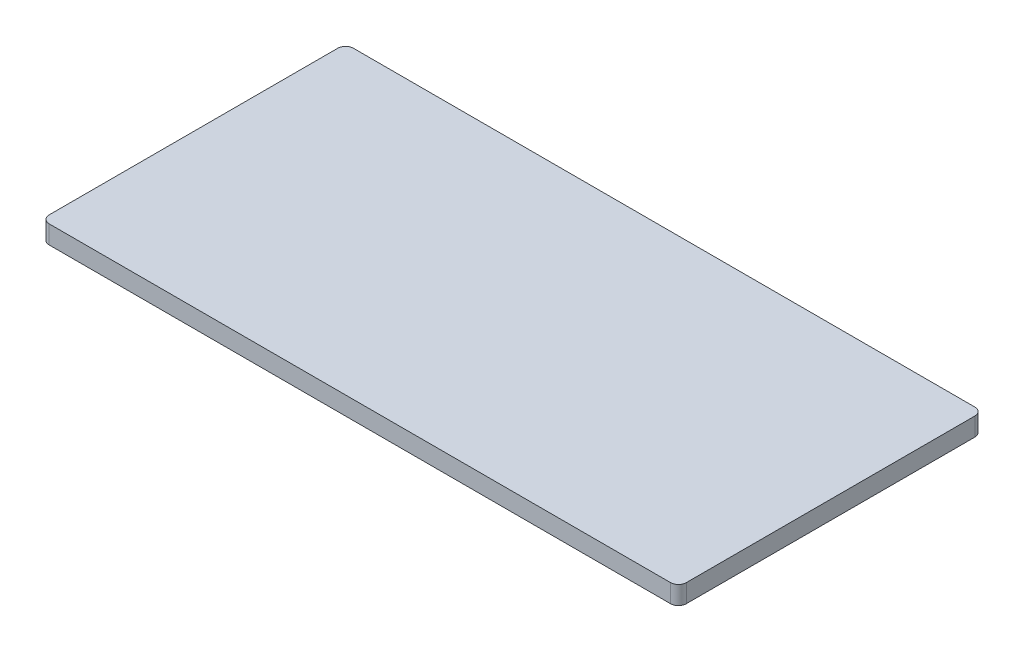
ISO-10303-21;
HEADER;
FILE_DESCRIPTION(('STEP AP214'),'2;1');
FILE_NAME('part.step','',(''),(''),'','','');
FILE_SCHEMA(('AUTOMOTIVE_DESIGN { 1 0 10303 214 1 1 1 1 }'));
ENDSEC;
DATA;
#1=APPLICATION_CONTEXT('core data for automotive mechanical design processes');
#2=APPLICATION_PROTOCOL_DEFINITION('international standard','automotive_design',2000,#1);
#3=PRODUCT_CONTEXT('',#1,'mechanical');
#4=PRODUCT('Part','Part','',(#3));
#5=PRODUCT_RELATED_PRODUCT_CATEGORY('part','',(#4));
#6=PRODUCT_DEFINITION_FORMATION('','',#4);
#7=PRODUCT_DEFINITION_CONTEXT('part definition',#1,'design');
#8=PRODUCT_DEFINITION('design','',#6,#7);
#9=PRODUCT_DEFINITION_SHAPE('','',#8);
#10=(LENGTH_UNIT() NAMED_UNIT(*) SI_UNIT(.MILLI.,.METRE.));
#11=(NAMED_UNIT(*) PLANE_ANGLE_UNIT() SI_UNIT($,.RADIAN.));
#12=(NAMED_UNIT(*) SI_UNIT($,.STERADIAN.) SOLID_ANGLE_UNIT());
#13=UNCERTAINTY_MEASURE_WITH_UNIT(LENGTH_MEASURE(1.E-05),#10,'distance_accuracy_value','');
#14=(GEOMETRIC_REPRESENTATION_CONTEXT(3) GLOBAL_UNCERTAINTY_ASSIGNED_CONTEXT((#13)) GLOBAL_UNIT_ASSIGNED_CONTEXT((#10,
#11,#12)) REPRESENTATION_CONTEXT('',''));
#15=CARTESIAN_POINT('',(0.,0.,0.));
#16=DIRECTION('',(0.,0.,1.));
#17=DIRECTION('',(1.,0.,0.));
#18=AXIS2_PLACEMENT_3D('',#15,#16,#17);
#19=CARTESIAN_POINT('',(560.,-5.,-260.));
#20=DIRECTION('',(0.,-1.,0.));
#21=DIRECTION('',(0.,0.,-1.));
#22=AXIS2_PLACEMENT_3D('',#19,#20,#21);
#23=PLANE('',#22);
#24=DIRECTION('',(1.,0.,0.));
#25=VECTOR('',#24,1.);
#26=CARTESIAN_POINT('',(560.,-5.,260.));
#27=LINE('',#26,#25);
#28=CARTESIAN_POINT('',(108.89320203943,-5.,260.));
#29=VERTEX_POINT('',#28);
#30=CARTESIAN_POINT('',(539.171572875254,-5.,260.));
#31=VERTEX_POINT('',#30);
#32=EDGE_CURVE('E348',#29,#31,#27,.T.);
#33=ORIENTED_EDGE('',*,*,#32,.T.);
#34=CARTESIAN_POINT('',(539.171572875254,-5.,239.171572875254));
#35=DIRECTION('',(0.,-1.,0.));
#36=DIRECTION('',(0.,0.,-1.));
#37=AXIS2_PLACEMENT_3D('',#34,#35,#36);
#38=CIRCLE('',#37,20.8284271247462);
#39=CARTESIAN_POINT('',(560.,-5.,239.171572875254));
#40=VERTEX_POINT('',#39);
#41=EDGE_CURVE('E374',#31,#40,#38,.F.);
#42=ORIENTED_EDGE('',*,*,#41,.T.);
#43=DIRECTION('',(0.,0.,-1.));
#44=VECTOR('',#43,1.);
#45=CARTESIAN_POINT('',(560.,-5.,-260.));
#46=LINE('',#45,#44);
#47=CARTESIAN_POINT('',(560.,-5.,-239.171572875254));
#48=VERTEX_POINT('',#47);
#49=EDGE_CURVE('E372',#40,#48,#46,.T.);
#50=ORIENTED_EDGE('',*,*,#49,.T.);
#51=CARTESIAN_POINT('',(539.171572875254,-5.,-239.171572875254));
#52=DIRECTION('',(0.,-1.,0.));
#53=DIRECTION('',(0.,0.,-1.));
#54=AXIS2_PLACEMENT_3D('',#51,#52,#53);
#55=CIRCLE('',#54,20.8284271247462);
#56=CARTESIAN_POINT('',(539.171572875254,-5.,-260.));
#57=VERTEX_POINT('',#56);
#58=EDGE_CURVE('E370',#48,#57,#55,.F.);
#59=ORIENTED_EDGE('',*,*,#58,.T.);
#60=DIRECTION('',(-1.,0.,0.));
#61=VECTOR('',#60,1.);
#62=CARTESIAN_POINT('',(560.,-5.,-260.));
#63=LINE('',#62,#61);
#64=CARTESIAN_POINT('',(-539.171572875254,-5.,-260.));
#65=VERTEX_POINT('',#64);
#66=EDGE_CURVE('E368',#57,#65,#63,.T.);
#67=ORIENTED_EDGE('',*,*,#66,.T.);
#68=CARTESIAN_POINT('',(-539.171572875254,-5.,-239.171572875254));
#69=DIRECTION('',(0.,-1.,0.));
#70=DIRECTION('',(0.,0.,-1.));
#71=AXIS2_PLACEMENT_3D('',#68,#69,#70);
#72=CIRCLE('',#71,20.8284271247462);
#73=CARTESIAN_POINT('',(-560.,-5.,-239.171572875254));
#74=VERTEX_POINT('',#73);
#75=EDGE_CURVE('E366',#65,#74,#72,.F.);
#76=ORIENTED_EDGE('',*,*,#75,.T.);
#77=DIRECTION('',(0.,0.,1.));
#78=VECTOR('',#77,1.);
#79=CARTESIAN_POINT('',(-560.,-5.,-260.));
#80=LINE('',#79,#78);
#81=CARTESIAN_POINT('',(-560.,-5.,239.171572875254));
#82=VERTEX_POINT('',#81);
#83=EDGE_CURVE('E364',#74,#82,#80,.T.);
#84=ORIENTED_EDGE('',*,*,#83,.T.);
#85=CARTESIAN_POINT('',(-539.171572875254,-5.,239.171572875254));
#86=DIRECTION('',(0.,-1.,0.));
#87=DIRECTION('',(0.,0.,-1.));
#88=AXIS2_PLACEMENT_3D('',#85,#86,#87);
#89=CIRCLE('',#88,20.8284271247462);
#90=CARTESIAN_POINT('',(-539.171572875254,-5.,260.));
#91=VERTEX_POINT('',#90);
#92=EDGE_CURVE('E362',#82,#91,#89,.F.);
#93=ORIENTED_EDGE('',*,*,#92,.T.);
#94=DIRECTION('',(1.,0.,0.));
#95=VECTOR('',#94,1.);
#96=CARTESIAN_POINT('',(560.,-5.,260.));
#97=LINE('',#96,#95);
#98=CARTESIAN_POINT('',(-108.89320203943,-5.,260.));
#99=VERTEX_POINT('',#98);
#100=EDGE_CURVE('E360',#91,#99,#97,.T.);
#101=ORIENTED_EDGE('',*,*,#100,.T.);
#102=CARTESIAN_POINT('',(-108.89320203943,-5.,229.171572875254));
#103=DIRECTION('',(0.,-1.,0.));
#104=DIRECTION('',(0.,0.,-1.));
#105=AXIS2_PLACEMENT_3D('',#102,#103,#104);
#106=CIRCLE('',#105,30.8284271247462);
#107=CARTESIAN_POINT('',(-92.092068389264,-5.,255.019470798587));
#108=VERTEX_POINT('',#107);
#109=EDGE_CURVE('E358',#99,#108,#106,.F.);
#110=ORIENTED_EDGE('',*,*,#109,.T.);
#111=DIRECTION('',(0.838443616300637,0.,-0.544988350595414));
#112=VECTOR('',#111,1.);
#113=CARTESIAN_POINT('',(601.654662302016,-5.,-195.915904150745));
#114=LINE('',#113,#112);
#115=CARTESIAN_POINT('',(-15.8981673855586,-5.,205.493435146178));
#116=VERTEX_POINT('',#115);
#117=EDGE_CURVE('E356',#108,#116,#114,.T.);
#118=ORIENTED_EDGE('',*,*,#117,.T.);
#119=CARTESIAN_POINT('',(0.,-5.,229.952154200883));
#120=DIRECTION('',(0.,-1.,0.));
#121=DIRECTION('',(0.,0.,-1.));
#122=AXIS2_PLACEMENT_3D('',#119,#120,#121);
#123=CIRCLE('',#122,29.1715728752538);
#124=CARTESIAN_POINT('',(15.8981673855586,-5.,205.493435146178));
#125=VERTEX_POINT('',#124);
#126=EDGE_CURVE('E354',#116,#125,#123,.T.);
#127=ORIENTED_EDGE('',*,*,#126,.T.);
#128=DIRECTION('',(0.838443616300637,0.,0.544988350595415));
#129=VECTOR('',#128,1.);
#130=CARTESIAN_POINT('',(185.691559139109,-5.,315.859139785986));
#131=LINE('',#130,#129);
#132=CARTESIAN_POINT('',(92.0920683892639,-5.,255.019470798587));
#133=VERTEX_POINT('',#132);
#134=EDGE_CURVE('E352',#125,#133,#131,.T.);
#135=ORIENTED_EDGE('',*,*,#134,.T.);
#136=CARTESIAN_POINT('',(108.89320203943,-5.,229.171572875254));
#137=DIRECTION('',(0.,-1.,0.));
#138=DIRECTION('',(0.,0.,-1.));
#139=AXIS2_PLACEMENT_3D('',#136,#137,#138);
#140=CIRCLE('',#139,30.8284271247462);
#141=EDGE_CURVE('E350',#133,#29,#140,.F.);
#142=ORIENTED_EDGE('',*,*,#141,.T.);
#143=EDGE_LOOP('',(#33,#42,#50,#59,#67,#76,#84,#93,#101,#110,#118,#127,#135,#142));
#144=FACE_BOUND('',#143,.T.);
#145=CARTESIAN_POINT('',(-560.,-5.,-260.));
#146=DIRECTION('',(0.,-1.,0.));
#147=DIRECTION('',(0.,0.,-1.));
#148=AXIS2_PLACEMENT_3D('',#145,#146,#147);
#149=CIRCLE('',#148,14.1715728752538);
#150=CARTESIAN_POINT('',(-574.171572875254,-5.,-260.));
#151=VERTEX_POINT('',#150);
#152=CARTESIAN_POINT('',(-560.,-5.,-274.171572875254));
#153=VERTEX_POINT('',#152);
#154=EDGE_CURVE('E337',#151,#153,#149,.T.);
#155=ORIENTED_EDGE('',*,*,#154,.T.);
#156=DIRECTION('',(-1.,0.,0.));
#157=VECTOR('',#156,1.);
#158=CARTESIAN_POINT('',(560.,-5.,-274.171572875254));
#159=LINE('',#158,#157);
#160=CARTESIAN_POINT('',(560.,-5.,-274.171572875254));
#161=VERTEX_POINT('',#160);
#162=EDGE_CURVE('E340',#153,#161,#159,.F.);
#163=ORIENTED_EDGE('',*,*,#162,.T.);
#164=CARTESIAN_POINT('',(560.,-5.,-260.));
#165=DIRECTION('',(0.,-1.,0.));
#166=DIRECTION('',(0.,0.,-1.));
#167=AXIS2_PLACEMENT_3D('',#164,#165,#166);
#168=CIRCLE('',#167,14.1715728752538);
#169=CARTESIAN_POINT('',(574.171572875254,-5.,-260.));
#170=VERTEX_POINT('',#169);
#171=EDGE_CURVE('E313',#161,#170,#168,.T.);
#172=ORIENTED_EDGE('',*,*,#171,.T.);
#173=DIRECTION('',(0.,0.,-1.));
#174=VECTOR('',#173,1.);
#175=CARTESIAN_POINT('',(574.171572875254,-5.,-260.));
#176=LINE('',#175,#174);
#177=CARTESIAN_POINT('',(574.171572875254,-5.,260.));
#178=VERTEX_POINT('',#177);
#179=EDGE_CURVE('E278',#170,#178,#176,.F.);
#180=ORIENTED_EDGE('',*,*,#179,.T.);
#181=CARTESIAN_POINT('',(560.,-5.,260.));
#182=DIRECTION('',(0.,-1.,0.));
#183=DIRECTION('',(0.,0.,-1.));
#184=AXIS2_PLACEMENT_3D('',#181,#182,#183);
#185=CIRCLE('',#184,14.1715728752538);
#186=CARTESIAN_POINT('',(560.,-5.,274.171572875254));
#187=VERTEX_POINT('',#186);
#188=EDGE_CURVE('E325',#178,#187,#185,.T.);
#189=ORIENTED_EDGE('',*,*,#188,.T.);
#190=DIRECTION('',(1.,0.,0.));
#191=VECTOR('',#190,1.);
#192=CARTESIAN_POINT('',(560.,-5.,274.171572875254));
#193=LINE('',#192,#191);
#194=CARTESIAN_POINT('',(-560.,-5.,274.171572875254));
#195=VERTEX_POINT('',#194);
#196=EDGE_CURVE('E328',#187,#195,#193,.F.);
#197=ORIENTED_EDGE('',*,*,#196,.T.);
#198=CARTESIAN_POINT('',(-560.,-5.,260.));
#199=DIRECTION('',(0.,-1.,0.));
#200=DIRECTION('',(0.,0.,-1.));
#201=AXIS2_PLACEMENT_3D('',#198,#199,#200);
#202=CIRCLE('',#201,14.1715728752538);
#203=CARTESIAN_POINT('',(-574.171572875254,-5.,260.));
#204=VERTEX_POINT('',#203);
#205=EDGE_CURVE('E331',#195,#204,#202,.T.);
#206=ORIENTED_EDGE('',*,*,#205,.T.);
#207=DIRECTION('',(0.,0.,1.));
#208=VECTOR('',#207,1.);
#209=CARTESIAN_POINT('',(-574.171572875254,-5.,-260.));
#210=LINE('',#209,#208);
#211=EDGE_CURVE('E334',#204,#151,#210,.F.);
#212=ORIENTED_EDGE('',*,*,#211,.T.);
#213=EDGE_LOOP('',(#155,#163,#172,#180,#189,#197,#206,#212));
#214=FACE_BOUND('',#213,.T.);
#215=ADVANCED_FACE('F37',(#144,#214),#23,.T.);
#216=CARTESIAN_POINT('',(-560.,28.,-260.));
#217=DIRECTION('',(0.,-1.,0.));
#218=DIRECTION('',(0.,0.,-1.));
#219=AXIS2_PLACEMENT_3D('',#216,#217,#218);
#220=CYLINDRICAL_SURFACE('',#219,14.1715728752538);
#221=ORIENTED_EDGE('',*,*,#154,.F.);
#222=DIRECTION('',(0.,-1.,0.));
#223=VECTOR('',#222,1.);
#224=CARTESIAN_POINT('',(-574.171572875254,28.,-260.));
#225=LINE('',#224,#223);
#226=CARTESIAN_POINT('',(-574.171572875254,28.,-260.));
#227=VERTEX_POINT('',#226);
#228=EDGE_CURVE('E311',#227,#151,#225,.T.);
#229=ORIENTED_EDGE('',*,*,#228,.F.);
#230=CARTESIAN_POINT('',(-560.,28.,-260.));
#231=DIRECTION('',(0.,-1.,0.));
#232=DIRECTION('',(0.,0.,-1.));
#233=AXIS2_PLACEMENT_3D('',#230,#231,#232);
#234=CIRCLE('',#233,14.1715728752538);
#235=CARTESIAN_POINT('',(-560.,28.,-274.171572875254));
#236=VERTEX_POINT('',#235);
#237=EDGE_CURVE('E574',#227,#236,#234,.T.);
#238=ORIENTED_EDGE('',*,*,#237,.T.);
#239=DIRECTION('',(0.,-1.,0.));
#240=VECTOR('',#239,1.);
#241=CARTESIAN_POINT('',(-560.,28.,-274.171572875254));
#242=LINE('',#241,#240);
#243=EDGE_CURVE('E310',#236,#153,#242,.T.);
#244=ORIENTED_EDGE('',*,*,#243,.T.);
#245=EDGE_LOOP('',(#221,#229,#238,#244));
#246=FACE_BOUND('',#245,.T.);
#247=ADVANCED_FACE('F584',(#246),#220,.T.);
#248=CARTESIAN_POINT('',(-574.171572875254,28.,260.));
#249=DIRECTION('',(-1.,0.,0.));
#250=DIRECTION('',(0.,0.,1.));
#251=AXIS2_PLACEMENT_3D('',#248,#249,#250);
#252=PLANE('',#251);
#253=ORIENTED_EDGE('',*,*,#211,.F.);
#254=DIRECTION('',(0.,-1.,0.));
#255=VECTOR('',#254,1.);
#256=CARTESIAN_POINT('',(-574.171572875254,28.,260.));
#257=LINE('',#256,#255);
#258=CARTESIAN_POINT('',(-574.171572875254,28.,260.));
#259=VERTEX_POINT('',#258);
#260=EDGE_CURVE('E314',#259,#204,#257,.T.);
#261=ORIENTED_EDGE('',*,*,#260,.F.);
#262=DIRECTION('',(0.,0.,-1.));
#263=VECTOR('',#262,1.);
#264=CARTESIAN_POINT('',(-574.171572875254,28.,260.));
#265=LINE('',#264,#263);
#266=EDGE_CURVE('E307',#259,#227,#265,.T.);
#267=ORIENTED_EDGE('',*,*,#266,.T.);
#268=ORIENTED_EDGE('',*,*,#228,.T.);
#269=EDGE_LOOP('',(#253,#261,#267,#268));
#270=FACE_BOUND('',#269,.T.);
#271=ADVANCED_FACE('F587',(#270),#252,.T.);
#272=CARTESIAN_POINT('',(-560.,28.,260.));
#273=DIRECTION('',(0.,-1.,0.));
#274=DIRECTION('',(0.,0.,-1.));
#275=AXIS2_PLACEMENT_3D('',#272,#273,#274);
#276=CYLINDRICAL_SURFACE('',#275,14.1715728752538);
#277=ORIENTED_EDGE('',*,*,#205,.F.);
#278=DIRECTION('',(0.,-1.,0.));
#279=VECTOR('',#278,1.);
#280=CARTESIAN_POINT('',(-560.,28.,274.171572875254));
#281=LINE('',#280,#279);
#282=CARTESIAN_POINT('',(-560.,28.,274.171572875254));
#283=VERTEX_POINT('',#282);
#284=EDGE_CURVE('E316',#283,#195,#281,.T.);
#285=ORIENTED_EDGE('',*,*,#284,.F.);
#286=CARTESIAN_POINT('',(-560.,28.,260.));
#287=DIRECTION('',(0.,-1.,0.));
#288=DIRECTION('',(0.,0.,-1.));
#289=AXIS2_PLACEMENT_3D('',#286,#287,#288);
#290=CIRCLE('',#289,14.1715728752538);
#291=EDGE_CURVE('E304',#283,#259,#290,.T.);
#292=ORIENTED_EDGE('',*,*,#291,.T.);
#293=ORIENTED_EDGE('',*,*,#260,.T.);
#294=EDGE_LOOP('',(#277,#285,#292,#293));
#295=FACE_BOUND('',#294,.T.);
#296=ADVANCED_FACE('F590',(#295),#276,.T.);
#297=CARTESIAN_POINT('',(560.,28.,274.171572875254));
#298=DIRECTION('',(0.,0.,1.));
#299=DIRECTION('',(1.,0.,0.));
#300=AXIS2_PLACEMENT_3D('',#297,#298,#299);
#301=PLANE('',#300);
#302=ORIENTED_EDGE('',*,*,#196,.F.);
#303=DIRECTION('',(0.,-1.,0.));
#304=VECTOR('',#303,1.);
#305=CARTESIAN_POINT('',(560.,28.,274.171572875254));
#306=LINE('',#305,#304);
#307=CARTESIAN_POINT('',(560.,28.,274.171572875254));
#308=VERTEX_POINT('',#307);
#309=EDGE_CURVE('E318',#308,#187,#306,.T.);
#310=ORIENTED_EDGE('',*,*,#309,.F.);
#311=DIRECTION('',(-1.,0.,0.));
#312=VECTOR('',#311,1.);
#313=CARTESIAN_POINT('',(560.,28.,274.171572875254));
#314=LINE('',#313,#312);
#315=EDGE_CURVE('E298',#308,#283,#314,.T.);
#316=ORIENTED_EDGE('',*,*,#315,.T.);
#317=ORIENTED_EDGE('',*,*,#284,.T.);
#318=EDGE_LOOP('',(#302,#310,#316,#317));
#319=FACE_BOUND('',#318,.T.);
#320=ADVANCED_FACE('F593',(#319),#301,.T.);
#321=CARTESIAN_POINT('',(560.,28.,260.));
#322=DIRECTION('',(0.,-1.,0.));
#323=DIRECTION('',(0.,0.,-1.));
#324=AXIS2_PLACEMENT_3D('',#321,#322,#323);
#325=CYLINDRICAL_SURFACE('',#324,14.1715728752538);
#326=ORIENTED_EDGE('',*,*,#188,.F.);
#327=DIRECTION('',(0.,-1.,0.));
#328=VECTOR('',#327,1.);
#329=CARTESIAN_POINT('',(574.171572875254,28.,260.));
#330=LINE('',#329,#328);
#331=CARTESIAN_POINT('',(574.171572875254,28.,260.));
#332=VERTEX_POINT('',#331);
#333=EDGE_CURVE('E281',#332,#178,#330,.T.);
#334=ORIENTED_EDGE('',*,*,#333,.F.);
#335=CARTESIAN_POINT('',(560.,28.,260.));
#336=DIRECTION('',(0.,-1.,0.));
#337=DIRECTION('',(0.,0.,-1.));
#338=AXIS2_PLACEMENT_3D('',#335,#336,#337);
#339=CIRCLE('',#338,14.1715728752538);
#340=EDGE_CURVE('E296',#332,#308,#339,.T.);
#341=ORIENTED_EDGE('',*,*,#340,.T.);
#342=ORIENTED_EDGE('',*,*,#309,.T.);
#343=EDGE_LOOP('',(#326,#334,#341,#342));
#344=FACE_BOUND('',#343,.T.);
#345=ADVANCED_FACE('F596',(#344),#325,.T.);
#346=CARTESIAN_POINT('',(574.171572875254,28.,-260.));
#347=DIRECTION('',(1.,0.,0.));
#348=DIRECTION('',(0.,0.,-1.));
#349=AXIS2_PLACEMENT_3D('',#346,#347,#348);
#350=PLANE('',#349);
#351=ORIENTED_EDGE('',*,*,#179,.F.);
#352=DIRECTION('',(0.,-1.,0.));
#353=VECTOR('',#352,1.);
#354=CARTESIAN_POINT('',(574.171572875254,28.,-260.));
#355=LINE('',#354,#353);
#356=CARTESIAN_POINT('',(574.171572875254,28.,-260.));
#357=VERTEX_POINT('',#356);
#358=EDGE_CURVE('E271',#357,#170,#355,.T.);
#359=ORIENTED_EDGE('',*,*,#358,.F.);
#360=DIRECTION('',(0.,0.,1.));
#361=VECTOR('',#360,1.);
#362=CARTESIAN_POINT('',(574.171572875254,28.,-260.));
#363=LINE('',#362,#361);
#364=EDGE_CURVE('E275',#357,#332,#363,.T.);
#365=ORIENTED_EDGE('',*,*,#364,.T.);
#366=ORIENTED_EDGE('',*,*,#333,.T.);
#367=EDGE_LOOP('',(#351,#359,#365,#366));
#368=FACE_BOUND('',#367,.T.);
#369=ADVANCED_FACE('F273',(#368),#350,.T.);
#370=CARTESIAN_POINT('',(560.,28.,-260.));
#371=DIRECTION('',(0.,-1.,0.));
#372=DIRECTION('',(0.,0.,-1.));
#373=AXIS2_PLACEMENT_3D('',#370,#371,#372);
#374=CYLINDRICAL_SURFACE('',#373,14.1715728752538);
#375=ORIENTED_EDGE('',*,*,#171,.F.);
#376=DIRECTION('',(0.,-1.,0.));
#377=VECTOR('',#376,1.);
#378=CARTESIAN_POINT('',(560.,28.,-274.171572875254));
#379=LINE('',#378,#377);
#380=CARTESIAN_POINT('',(560.,28.,-274.171572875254));
#381=VERTEX_POINT('',#380);
#382=EDGE_CURVE('E282',#381,#161,#379,.T.);
#383=ORIENTED_EDGE('',*,*,#382,.F.);
#384=CARTESIAN_POINT('',(560.,28.,-260.));
#385=DIRECTION('',(0.,-1.,0.));
#386=DIRECTION('',(0.,0.,-1.));
#387=AXIS2_PLACEMENT_3D('',#384,#385,#386);
#388=CIRCLE('',#387,14.1715728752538);
#389=EDGE_CURVE('E285',#381,#357,#388,.T.);
#390=ORIENTED_EDGE('',*,*,#389,.T.);
#391=ORIENTED_EDGE('',*,*,#358,.T.);
#392=EDGE_LOOP('',(#375,#383,#390,#391));
#393=FACE_BOUND('',#392,.T.);
#394=ADVANCED_FACE('F286',(#393),#374,.T.);
#395=CARTESIAN_POINT('',(-560.,28.,-274.171572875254));
#396=DIRECTION('',(0.,0.,-1.));
#397=DIRECTION('',(-1.,0.,0.));
#398=AXIS2_PLACEMENT_3D('',#395,#396,#397);
#399=PLANE('',#398);
#400=ORIENTED_EDGE('',*,*,#162,.F.);
#401=ORIENTED_EDGE('',*,*,#243,.F.);
#402=DIRECTION('',(1.,0.,0.));
#403=VECTOR('',#402,1.);
#404=CARTESIAN_POINT('',(-560.,28.,-274.171572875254));
#405=LINE('',#404,#403);
#406=EDGE_CURVE('E291',#236,#381,#405,.T.);
#407=ORIENTED_EDGE('',*,*,#406,.T.);
#408=ORIENTED_EDGE('',*,*,#382,.T.);
#409=EDGE_LOOP('',(#400,#401,#407,#408));
#410=FACE_BOUND('',#409,.T.);
#411=ADVANCED_FACE('F578',(#410),#399,.T.);
#412=CARTESIAN_POINT('',(0.,28.,0.));
#413=DIRECTION('',(0.,1.,0.));
#414=DIRECTION('',(0.,0.,1.));
#415=AXIS2_PLACEMENT_3D('',#412,#413,#414);
#416=PLANE('',#415);
#417=ORIENTED_EDGE('',*,*,#406,.F.);
#418=ORIENTED_EDGE('',*,*,#237,.F.);
#419=ORIENTED_EDGE('',*,*,#266,.F.);
#420=ORIENTED_EDGE('',*,*,#291,.F.);
#421=ORIENTED_EDGE('',*,*,#315,.F.);
#422=ORIENTED_EDGE('',*,*,#340,.F.);
#423=ORIENTED_EDGE('',*,*,#364,.F.);
#424=ORIENTED_EDGE('',*,*,#389,.F.);
#425=EDGE_LOOP('',(#417,#418,#419,#420,#421,#422,#423,#424));
#426=FACE_BOUND('',#425,.T.);
#427=ADVANCED_FACE('F293',(#426),#416,.T.);
#428=CARTESIAN_POINT('',(-539.171572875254,-5.,239.171572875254));
#429=DIRECTION('',(0.,1.,0.));
#430=DIRECTION('',(0.,0.,-1.));
#431=AXIS2_PLACEMENT_3D('',#428,#429,#430);
#432=CONICAL_SURFACE('',#431,20.0000000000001,0.78539816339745);
#433=DIRECTION('',(0.,0.707106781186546,0.707106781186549));
#434=VECTOR('',#433,1.);
#435=CARTESIAN_POINT('',(-539.171572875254,-5.00000000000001,259.171572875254));
#436=LINE('',#435,#434);
#437=CARTESIAN_POINT('',(-539.171572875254,-8.4142135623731,255.757359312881));
#438=VERTEX_POINT('',#437);
#439=CARTESIAN_POINT('',(-539.171572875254,-5.58578643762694,258.585786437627));
#440=VERTEX_POINT('',#439);
#441=EDGE_CURVE('E493',#438,#440,#436,.T.);
#442=ORIENTED_EDGE('',*,*,#441,.T.);
#443=CARTESIAN_POINT('',(-539.171572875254,-5.5857864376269,239.171572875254));
#444=DIRECTION('',(0.,-1.,0.));
#445=DIRECTION('',(0.,0.,-1.));
#446=AXIS2_PLACEMENT_3D('',#443,#444,#445);
#447=CIRCLE('',#446,19.4142135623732);
#448=CARTESIAN_POINT('',(-558.585786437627,-5.58578643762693,239.171572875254));
#449=VERTEX_POINT('',#448);
#450=EDGE_CURVE('E399',#440,#449,#447,.T.);
#451=ORIENTED_EDGE('',*,*,#450,.T.);
#452=DIRECTION('',(-0.707106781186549,0.707106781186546,0.));
#453=VECTOR('',#452,1.);
#454=CARTESIAN_POINT('',(-559.171572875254,-5.,239.171572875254));
#455=LINE('',#454,#453);
#456=CARTESIAN_POINT('',(-555.757359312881,-8.41421356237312,239.171572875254));
#457=VERTEX_POINT('',#456);
#458=EDGE_CURVE('E573',#457,#449,#455,.T.);
#459=ORIENTED_EDGE('',*,*,#458,.F.);
#460=CARTESIAN_POINT('',(-539.171572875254,-8.4142135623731,239.171572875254));
#461=DIRECTION('',(0.,1.,0.));
#462=DIRECTION('',(0.,0.,1.));
#463=AXIS2_PLACEMENT_3D('',#460,#461,#462);
#464=CIRCLE('',#463,16.585786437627);
#465=EDGE_CURVE('E397',#457,#438,#464,.T.);
#466=ORIENTED_EDGE('',*,*,#465,.T.);
#467=EDGE_LOOP('',(#442,#451,#459,#466));
#468=FACE_BOUND('',#467,.T.);
#469=ADVANCED_FACE('F877',(#468),#432,.T.);
#470=CARTESIAN_POINT('',(-559.171572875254,-5.,239.171572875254));
#471=DIRECTION('',(-0.707106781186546,-0.707106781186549,0.));
#472=DIRECTION('',(0.707106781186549,-0.707106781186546,0.));
#473=AXIS2_PLACEMENT_3D('',#470,#471,#472);
#474=PLANE('',#473);
#475=ORIENTED_EDGE('',*,*,#458,.T.);
#476=DIRECTION('',(0.,0.,-1.));
#477=VECTOR('',#476,1.);
#478=CARTESIAN_POINT('',(-558.585786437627,-5.58578643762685,239.171572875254));
#479=LINE('',#478,#477);
#480=CARTESIAN_POINT('',(-558.585786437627,-5.58578643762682,-239.171572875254));
#481=VERTEX_POINT('',#480);
#482=EDGE_CURVE('E395',#449,#481,#479,.T.);
#483=ORIENTED_EDGE('',*,*,#482,.T.);
#484=DIRECTION('',(-0.707106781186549,0.707106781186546,0.));
#485=VECTOR('',#484,1.);
#486=CARTESIAN_POINT('',(-559.171572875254,-5.00000000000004,-239.171572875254));
#487=LINE('',#486,#485);
#488=CARTESIAN_POINT('',(-555.757359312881,-8.4142135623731,-239.171572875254));
#489=VERTEX_POINT('',#488);
#490=EDGE_CURVE('E570',#489,#481,#487,.T.);
#491=ORIENTED_EDGE('',*,*,#490,.F.);
#492=DIRECTION('',(0.,0.,-1.));
#493=VECTOR('',#492,1.);
#494=CARTESIAN_POINT('',(-555.757359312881,-8.41421356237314,239.171572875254));
#495=LINE('',#494,#493);
#496=EDGE_CURVE('E393',#489,#457,#495,.F.);
#497=ORIENTED_EDGE('',*,*,#496,.T.);
#498=EDGE_LOOP('',(#475,#483,#491,#497));
#499=FACE_BOUND('',#498,.T.);
#500=ADVANCED_FACE('F869',(#499),#474,.T.);
#501=CARTESIAN_POINT('',(-539.171572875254,-5.,-239.171572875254));
#502=DIRECTION('',(0.,1.,0.));
#503=DIRECTION('',(0.,0.,1.));
#504=AXIS2_PLACEMENT_3D('',#501,#502,#503);
#505=CONICAL_SURFACE('',#504,20.0000000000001,0.78539816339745);
#506=ORIENTED_EDGE('',*,*,#490,.T.);
#507=CARTESIAN_POINT('',(-539.171572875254,-5.5857864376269,-239.171572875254));
#508=DIRECTION('',(0.,-1.,0.));
#509=DIRECTION('',(0.,0.,-1.));
#510=AXIS2_PLACEMENT_3D('',#507,#508,#509);
#511=CIRCLE('',#510,19.4142135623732);
#512=CARTESIAN_POINT('',(-539.171572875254,-5.58578643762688,-258.585786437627));
#513=VERTEX_POINT('',#512);
#514=EDGE_CURVE('E391',#481,#513,#511,.T.);
#515=ORIENTED_EDGE('',*,*,#514,.T.);
#516=DIRECTION('',(0.,0.707106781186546,-0.707106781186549));
#517=VECTOR('',#516,1.);
#518=CARTESIAN_POINT('',(-539.171572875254,-5.,-259.171572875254));
#519=LINE('',#518,#517);
#520=CARTESIAN_POINT('',(-539.171572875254,-8.41421356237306,-255.757359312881));
#521=VERTEX_POINT('',#520);
#522=EDGE_CURVE('E567',#521,#513,#519,.T.);
#523=ORIENTED_EDGE('',*,*,#522,.F.);
#524=CARTESIAN_POINT('',(-539.171572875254,-8.4142135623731,-239.171572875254));
#525=DIRECTION('',(0.,1.,0.));
#526=DIRECTION('',(0.,0.,1.));
#527=AXIS2_PLACEMENT_3D('',#524,#525,#526);
#528=CIRCLE('',#527,16.585786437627);
#529=EDGE_CURVE('E389',#521,#489,#528,.T.);
#530=ORIENTED_EDGE('',*,*,#529,.T.);
#531=EDGE_LOOP('',(#506,#515,#523,#530));
#532=FACE_BOUND('',#531,.T.);
#533=ADVANCED_FACE('F861',(#532),#505,.T.);
#534=CARTESIAN_POINT('',(539.171572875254,-5.,-259.171572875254));
#535=DIRECTION('',(0.,-0.707106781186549,-0.707106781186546));
#536=DIRECTION('',(0.,0.707106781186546,-0.707106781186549));
#537=AXIS2_PLACEMENT_3D('',#534,#535,#536);
#538=PLANE('',#537);
#539=ORIENTED_EDGE('',*,*,#522,.T.);
#540=DIRECTION('',(1.,0.,0.));
#541=VECTOR('',#540,1.);
#542=CARTESIAN_POINT('',(539.171572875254,-5.58578643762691,-258.585786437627));
#543=LINE('',#542,#541);
#544=CARTESIAN_POINT('',(539.171572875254,-5.58578643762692,-258.585786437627));
#545=VERTEX_POINT('',#544);
#546=EDGE_CURVE('E387',#513,#545,#543,.T.);
#547=ORIENTED_EDGE('',*,*,#546,.T.);
#548=DIRECTION('',(0.,0.707106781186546,-0.707106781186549));
#549=VECTOR('',#548,1.);
#550=CARTESIAN_POINT('',(539.171572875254,-5.00000000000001,-259.171572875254));
#551=LINE('',#550,#549);
#552=CARTESIAN_POINT('',(539.171572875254,-8.41421356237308,-255.757359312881));
#553=VERTEX_POINT('',#552);
#554=EDGE_CURVE('E559',#553,#545,#551,.T.);
#555=ORIENTED_EDGE('',*,*,#554,.F.);
#556=DIRECTION('',(1.,0.,0.));
#557=VECTOR('',#556,1.);
#558=CARTESIAN_POINT('',(-539.171572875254,-8.41421356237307,-255.757359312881));
#559=LINE('',#558,#557);
#560=EDGE_CURVE('E385',#553,#521,#559,.F.);
#561=ORIENTED_EDGE('',*,*,#560,.T.);
#562=EDGE_LOOP('',(#539,#547,#555,#561));
#563=FACE_BOUND('',#562,.T.);
#564=ADVANCED_FACE('F853',(#563),#538,.T.);
#565=CARTESIAN_POINT('',(539.171572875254,-5.,-239.171572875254));
#566=DIRECTION('',(0.,1.,0.));
#567=DIRECTION('',(0.,0.,1.));
#568=AXIS2_PLACEMENT_3D('',#565,#566,#567);
#569=CONICAL_SURFACE('',#568,20.,0.78539816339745);
#570=ORIENTED_EDGE('',*,*,#554,.T.);
#571=CARTESIAN_POINT('',(539.171572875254,-5.5857864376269,-239.171572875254));
#572=DIRECTION('',(0.,-1.,0.));
#573=DIRECTION('',(0.,0.,-1.));
#574=AXIS2_PLACEMENT_3D('',#571,#572,#573);
#575=CIRCLE('',#574,19.4142135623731);
#576=CARTESIAN_POINT('',(558.585786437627,-5.58578643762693,-239.171572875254));
#577=VERTEX_POINT('',#576);
#578=EDGE_CURVE('E383',#545,#577,#575,.T.);
#579=ORIENTED_EDGE('',*,*,#578,.T.);
#580=DIRECTION('',(0.707106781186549,0.707106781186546,0.));
#581=VECTOR('',#580,1.);
#582=CARTESIAN_POINT('',(559.171572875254,-5.,-239.171572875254));
#583=LINE('',#582,#581);
#584=CARTESIAN_POINT('',(555.75735931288,-8.41421356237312,-239.171572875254));
#585=VERTEX_POINT('',#584);
#586=EDGE_CURVE('E557',#585,#577,#583,.T.);
#587=ORIENTED_EDGE('',*,*,#586,.F.);
#588=CARTESIAN_POINT('',(539.171572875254,-8.4142135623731,-239.171572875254));
#589=DIRECTION('',(0.,1.,0.));
#590=DIRECTION('',(0.,0.,1.));
#591=AXIS2_PLACEMENT_3D('',#588,#589,#590);
#592=CIRCLE('',#591,16.5857864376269);
#593=EDGE_CURVE('E381',#585,#553,#592,.T.);
#594=ORIENTED_EDGE('',*,*,#593,.T.);
#595=EDGE_LOOP('',(#570,#579,#587,#594));
#596=FACE_BOUND('',#595,.T.);
#597=ADVANCED_FACE('F846',(#596),#569,.T.);
#598=CARTESIAN_POINT('',(559.171572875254,-5.,239.171572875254));
#599=DIRECTION('',(0.707106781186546,-0.707106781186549,0.));
#600=DIRECTION('',(0.707106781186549,0.707106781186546,0.));
#601=AXIS2_PLACEMENT_3D('',#598,#599,#600);
#602=PLANE('',#601);
#603=ORIENTED_EDGE('',*,*,#586,.T.);
#604=DIRECTION('',(0.,0.,1.));
#605=VECTOR('',#604,1.);
#606=CARTESIAN_POINT('',(558.585786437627,-5.58578643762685,239.171572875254));
#607=LINE('',#606,#605);
#608=CARTESIAN_POINT('',(558.585786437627,-5.58578643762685,239.171572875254));
#609=VERTEX_POINT('',#608);
#610=EDGE_CURVE('E379',#577,#609,#607,.T.);
#611=ORIENTED_EDGE('',*,*,#610,.T.);
#612=DIRECTION('',(0.707106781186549,0.707106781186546,0.));
#613=VECTOR('',#612,1.);
#614=CARTESIAN_POINT('',(559.171572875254,-4.99999999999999,239.171572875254));
#615=LINE('',#614,#613);
#616=CARTESIAN_POINT('',(555.75735931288,-8.41421356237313,239.171572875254));
#617=VERTEX_POINT('',#616);
#618=EDGE_CURVE('E548',#617,#609,#615,.T.);
#619=ORIENTED_EDGE('',*,*,#618,.F.);
#620=DIRECTION('',(0.,0.,1.));
#621=VECTOR('',#620,1.);
#622=CARTESIAN_POINT('',(555.75735931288,-8.41421356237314,-239.171572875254));
#623=LINE('',#622,#621);
#624=EDGE_CURVE('E377',#617,#585,#623,.F.);
#625=ORIENTED_EDGE('',*,*,#624,.T.);
#626=EDGE_LOOP('',(#603,#611,#619,#625));
#627=FACE_BOUND('',#626,.T.);
#628=ADVANCED_FACE('F554',(#627),#602,.T.);
#629=CARTESIAN_POINT('',(539.171572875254,-5.,239.171572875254));
#630=DIRECTION('',(0.,1.,0.));
#631=DIRECTION('',(0.,0.,1.));
#632=AXIS2_PLACEMENT_3D('',#629,#630,#631);
#633=CONICAL_SURFACE('',#632,20.,0.78539816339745);
#634=ORIENTED_EDGE('',*,*,#618,.T.);
#635=CARTESIAN_POINT('',(539.171572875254,-5.5857864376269,239.171572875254));
#636=DIRECTION('',(0.,-1.,0.));
#637=DIRECTION('',(0.,0.,-1.));
#638=AXIS2_PLACEMENT_3D('',#635,#636,#637);
#639=CIRCLE('',#638,19.4142135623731);
#640=CARTESIAN_POINT('',(539.171572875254,-5.58578643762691,258.585786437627));
#641=VERTEX_POINT('',#640);
#642=EDGE_CURVE('E345',#609,#641,#639,.T.);
#643=ORIENTED_EDGE('',*,*,#642,.T.);
#644=DIRECTION('',(0.,0.707106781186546,0.707106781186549));
#645=VECTOR('',#644,1.);
#646=CARTESIAN_POINT('',(539.171572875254,-5.,259.171572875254));
#647=LINE('',#646,#645);
#648=CARTESIAN_POINT('',(539.171572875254,-8.41421356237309,255.757359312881));
#649=VERTEX_POINT('',#648);
#650=EDGE_CURVE('E551',#649,#641,#647,.T.);
#651=ORIENTED_EDGE('',*,*,#650,.F.);
#652=CARTESIAN_POINT('',(539.171572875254,-8.4142135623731,239.171572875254));
#653=DIRECTION('',(0.,1.,0.));
#654=DIRECTION('',(0.,0.,1.));
#655=AXIS2_PLACEMENT_3D('',#652,#653,#654);
#656=CIRCLE('',#655,16.5857864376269);
#657=EDGE_CURVE('E343',#649,#617,#656,.T.);
#658=ORIENTED_EDGE('',*,*,#657,.T.);
#659=EDGE_LOOP('',(#634,#643,#651,#658));
#660=FACE_BOUND('',#659,.T.);
#661=ADVANCED_FACE('F547',(#660),#633,.T.);
#662=CARTESIAN_POINT('',(539.171572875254,-5.,259.171572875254));
#663=DIRECTION('',(0.,-0.707106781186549,0.707106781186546));
#664=DIRECTION('',(0.,-0.707106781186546,-0.707106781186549));
#665=AXIS2_PLACEMENT_3D('',#662,#663,#664);
#666=PLANE('',#665);
#667=DIRECTION('',(0.,0.707106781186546,0.707106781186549));
#668=VECTOR('',#667,1.);
#669=CARTESIAN_POINT('',(108.89320203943,-5.,259.171572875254));
#670=LINE('',#669,#668);
#671=CARTESIAN_POINT('',(108.89320203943,-8.41421356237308,255.757359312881));
#672=VERTEX_POINT('',#671);
#673=CARTESIAN_POINT('',(108.89320203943,-5.58578643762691,258.585786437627));
#674=VERTEX_POINT('',#673);
#675=EDGE_CURVE('E561',#672,#674,#670,.T.);
#676=ORIENTED_EDGE('',*,*,#675,.F.);
#677=DIRECTION('',(-1.,0.,0.));
#678=VECTOR('',#677,1.);
#679=CARTESIAN_POINT('',(539.171572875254,-8.41421356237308,255.757359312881));
#680=LINE('',#679,#678);
#681=EDGE_CURVE('E12',#672,#649,#680,.F.);
#682=ORIENTED_EDGE('',*,*,#681,.T.);
#683=ORIENTED_EDGE('',*,*,#650,.T.);
#684=DIRECTION('',(-1.,0.,0.));
#685=VECTOR('',#684,1.);
#686=CARTESIAN_POINT('',(539.171572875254,-5.58578643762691,258.585786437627));
#687=LINE('',#686,#685);
#688=EDGE_CURVE('E46',#641,#674,#687,.T.);
#689=ORIENTED_EDGE('',*,*,#688,.T.);
#690=EDGE_LOOP('',(#676,#682,#683,#689));
#691=FACE_BOUND('',#690,.T.);
#692=ADVANCED_FACE('F825',(#691),#666,.T.);
#693=CARTESIAN_POINT('',(108.89320203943,-5.,229.171572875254));
#694=DIRECTION('',(0.,1.,0.));
#695=DIRECTION('',(0.,0.,1.));
#696=AXIS2_PLACEMENT_3D('',#693,#694,#695);
#697=CONICAL_SURFACE('',#696,30.,0.78539816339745);
#698=ORIENTED_EDGE('',*,*,#675,.T.);
#699=CARTESIAN_POINT('',(108.89320203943,-5.5857864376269,229.171572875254));
#700=DIRECTION('',(0.,-1.,0.));
#701=DIRECTION('',(0.,0.,-1.));
#702=AXIS2_PLACEMENT_3D('',#699,#700,#701);
#703=CIRCLE('',#702,29.4142135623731);
#704=CARTESIAN_POINT('',(92.8627983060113,-5.5857864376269,253.833732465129));
#705=VERTEX_POINT('',#704);
#706=EDGE_CURVE('E424',#674,#705,#703,.T.);
#707=ORIENTED_EDGE('',*,*,#706,.T.);
#708=DIRECTION('',(-0.38536495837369,0.707106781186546,0.592869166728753));
#709=VECTOR('',#708,1.);
#710=CARTESIAN_POINT('',(92.5435515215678,-5.,254.324881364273));
#711=LINE('',#710,#709);
#712=CARTESIAN_POINT('',(94.404258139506,-8.41421356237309,251.462255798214));
#713=VERTEX_POINT('',#712);
#714=EDGE_CURVE('E1244',#713,#705,#711,.T.);
#715=ORIENTED_EDGE('',*,*,#714,.F.);
#716=CARTESIAN_POINT('',(108.89320203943,-8.4142135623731,229.171572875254));
#717=DIRECTION('',(0.,1.,0.));
#718=DIRECTION('',(0.,0.,1.));
#719=AXIS2_PLACEMENT_3D('',#716,#717,#718);
#720=CIRCLE('',#719,26.5857864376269);
#721=EDGE_CURVE('E422',#713,#672,#720,.T.);
#722=ORIENTED_EDGE('',*,*,#721,.T.);
#723=EDGE_LOOP('',(#698,#707,#715,#722));
#724=FACE_BOUND('',#723,.T.);
#725=ADVANCED_FACE('F817',(#724),#697,.T.);
#726=CARTESIAN_POINT('',(92.5435515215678,-5.,254.324881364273));
#727=DIRECTION('',(-0.385364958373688,-0.707106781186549,0.592869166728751));
#728=DIRECTION('',(0.,-0.642492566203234,-0.766291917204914));
#729=AXIS2_PLACEMENT_3D('',#726,#727,#728);
#730=PLANE('',#729);
#731=ORIENTED_EDGE('',*,*,#714,.T.);
#732=DIRECTION('',(-0.838443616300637,0.,-0.544988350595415));
#733=VECTOR('',#732,1.);
#734=CARTESIAN_POINT('',(92.8627983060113,-5.58578643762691,253.833732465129));
#735=LINE('',#734,#733);
#736=CARTESIAN_POINT('',(16.668897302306,-5.58578643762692,204.307696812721));
#737=VERTEX_POINT('',#736);
#738=EDGE_CURVE('E420',#705,#737,#735,.T.);
#739=ORIENTED_EDGE('',*,*,#738,.T.);
#740=DIRECTION('',(-0.385364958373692,0.707106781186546,0.592869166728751));
#741=VECTOR('',#740,1.);
#742=CARTESIAN_POINT('',(16.3496505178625,-5.,204.798845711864));
#743=LINE('',#742,#741);
#744=CARTESIAN_POINT('',(18.2103571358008,-8.41421356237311,201.936220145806));
#745=VERTEX_POINT('',#744);
#746=EDGE_CURVE('E1241',#745,#737,#743,.T.);
#747=ORIENTED_EDGE('',*,*,#746,.F.);
#748=DIRECTION('',(-0.838443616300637,0.,-0.544988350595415));
#749=VECTOR('',#748,1.);
#750=CARTESIAN_POINT('',(94.4042581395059,-8.4142135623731,251.462255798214));
#751=LINE('',#750,#749);
#752=EDGE_CURVE('E418',#745,#713,#751,.F.);
#753=ORIENTED_EDGE('',*,*,#752,.T.);
#754=EDGE_LOOP('',(#731,#739,#747,#753));
#755=FACE_BOUND('',#754,.T.);
#756=ADVANCED_FACE('F809',(#755),#730,.T.);
#757=CARTESIAN_POINT('',(0.,-5.,229.952154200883));
#758=DIRECTION('',(0.,-1.,0.));
#759=DIRECTION('',(0.,0.,1.));
#760=AXIS2_PLACEMENT_3D('',#757,#758,#759);
#761=CONICAL_SURFACE('',#760,30.,0.78539816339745);
#762=ORIENTED_EDGE('',*,*,#746,.T.);
#763=CARTESIAN_POINT('',(0.,-5.58578643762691,229.952154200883));
#764=DIRECTION('',(0.,1.,0.));
#765=DIRECTION('',(0.,0.,1.));
#766=AXIS2_PLACEMENT_3D('',#763,#764,#765);
#767=CIRCLE('',#766,30.5857864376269);
#768=CARTESIAN_POINT('',(-16.668897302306,-5.5857864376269,204.307696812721));
#769=VERTEX_POINT('',#768);
#770=EDGE_CURVE('E416',#737,#769,#767,.T.);
#771=ORIENTED_EDGE('',*,*,#770,.T.);
#772=DIRECTION('',(0.385364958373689,0.707106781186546,0.592869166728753));
#773=VECTOR('',#772,1.);
#774=CARTESIAN_POINT('',(-16.3496505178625,-5.,204.798845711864));
#775=LINE('',#774,#773);
#776=CARTESIAN_POINT('',(-18.2103571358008,-8.4142135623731,201.936220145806));
#777=VERTEX_POINT('',#776);
#778=EDGE_CURVE('E1238',#777,#769,#775,.T.);
#779=ORIENTED_EDGE('',*,*,#778,.F.);
#780=CARTESIAN_POINT('',(0.,-8.4142135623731,229.952154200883));
#781=DIRECTION('',(0.,-1.,0.));
#782=DIRECTION('',(0.,0.,-1.));
#783=AXIS2_PLACEMENT_3D('',#780,#781,#782);
#784=CIRCLE('',#783,33.4142135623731);
#785=EDGE_CURVE('E414',#777,#745,#784,.T.);
#786=ORIENTED_EDGE('',*,*,#785,.T.);
#787=EDGE_LOOP('',(#762,#771,#779,#786));
#788=FACE_BOUND('',#787,.T.);
#789=ADVANCED_FACE('F801',(#788),#761,.F.);
#790=CARTESIAN_POINT('',(-16.3496505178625,-5.,204.798845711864));
#791=DIRECTION('',(0.385364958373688,-0.707106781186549,0.592869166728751));
#792=DIRECTION('',(0.,-0.642492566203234,-0.766291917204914));
#793=AXIS2_PLACEMENT_3D('',#790,#791,#792);
#794=PLANE('',#793);
#795=ORIENTED_EDGE('',*,*,#778,.T.);
#796=DIRECTION('',(-0.838443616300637,0.,0.544988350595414));
#797=VECTOR('',#796,1.);
#798=CARTESIAN_POINT('',(-16.668897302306,-5.5857864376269,204.307696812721));
#799=LINE('',#798,#797);
#800=CARTESIAN_POINT('',(-92.8627983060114,-5.58578643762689,253.833732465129));
#801=VERTEX_POINT('',#800);
#802=EDGE_CURVE('E412',#769,#801,#799,.T.);
#803=ORIENTED_EDGE('',*,*,#802,.T.);
#804=DIRECTION('',(0.38536495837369,0.707106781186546,0.592869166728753));
#805=VECTOR('',#804,1.);
#806=CARTESIAN_POINT('',(-92.5435515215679,-5.,254.324881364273));
#807=LINE('',#806,#805);
#808=CARTESIAN_POINT('',(-94.4042581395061,-8.41421356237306,251.462255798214));
#809=VERTEX_POINT('',#808);
#810=EDGE_CURVE('E1235',#809,#801,#807,.T.);
#811=ORIENTED_EDGE('',*,*,#810,.F.);
#812=DIRECTION('',(-0.838443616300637,0.,0.544988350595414));
#813=VECTOR('',#812,1.);
#814=CARTESIAN_POINT('',(-18.2103571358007,-8.41421356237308,201.936220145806));
#815=LINE('',#814,#813);
#816=EDGE_CURVE('E410',#809,#777,#815,.F.);
#817=ORIENTED_EDGE('',*,*,#816,.T.);
#818=EDGE_LOOP('',(#795,#803,#811,#817));
#819=FACE_BOUND('',#818,.T.);
#820=ADVANCED_FACE('F793',(#819),#794,.T.);
#821=CARTESIAN_POINT('',(-108.89320203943,-5.,229.171572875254));
#822=DIRECTION('',(0.,1.,0.));
#823=DIRECTION('',(0.,0.,-1.));
#824=AXIS2_PLACEMENT_3D('',#821,#822,#823);
#825=CONICAL_SURFACE('',#824,30.,0.78539816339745);
#826=ORIENTED_EDGE('',*,*,#810,.T.);
#827=CARTESIAN_POINT('',(-108.89320203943,-5.5857864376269,229.171572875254));
#828=DIRECTION('',(0.,-1.,0.));
#829=DIRECTION('',(0.,0.,-1.));
#830=AXIS2_PLACEMENT_3D('',#827,#828,#829);
#831=CIRCLE('',#830,29.4142135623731);
#832=CARTESIAN_POINT('',(-108.89320203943,-5.58578643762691,258.585786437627));
#833=VERTEX_POINT('',#832);
#834=EDGE_CURVE('E408',#801,#833,#831,.T.);
#835=ORIENTED_EDGE('',*,*,#834,.T.);
#836=DIRECTION('',(0.,0.707106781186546,0.707106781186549));
#837=VECTOR('',#836,1.);
#838=CARTESIAN_POINT('',(-108.89320203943,-5.,259.171572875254));
#839=LINE('',#838,#837);
#840=CARTESIAN_POINT('',(-108.89320203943,-8.41421356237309,255.757359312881));
#841=VERTEX_POINT('',#840);
#842=EDGE_CURVE('E1211',#841,#833,#839,.T.);
#843=ORIENTED_EDGE('',*,*,#842,.F.);
#844=CARTESIAN_POINT('',(-108.89320203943,-8.4142135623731,229.171572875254));
#845=DIRECTION('',(0.,1.,0.));
#846=DIRECTION('',(0.,0.,1.));
#847=AXIS2_PLACEMENT_3D('',#844,#845,#846);
#848=CIRCLE('',#847,26.5857864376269);
#849=EDGE_CURVE('E406',#841,#809,#848,.T.);
#850=ORIENTED_EDGE('',*,*,#849,.T.);
#851=EDGE_LOOP('',(#826,#835,#843,#850));
#852=FACE_BOUND('',#851,.T.);
#853=ADVANCED_FACE('F785',(#852),#825,.T.);
#854=CARTESIAN_POINT('',(-108.89320203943,-5.,259.171572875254));
#855=DIRECTION('',(0.,-0.707106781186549,0.707106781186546));
#856=DIRECTION('',(0.,-0.707106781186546,-0.707106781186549));
#857=AXIS2_PLACEMENT_3D('',#854,#855,#856);
#858=PLANE('',#857);
#859=ORIENTED_EDGE('',*,*,#842,.T.);
#860=DIRECTION('',(-1.,0.,0.));
#861=VECTOR('',#860,1.);
#862=CARTESIAN_POINT('',(-108.89320203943,-5.58578643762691,258.585786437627));
#863=LINE('',#862,#861);
#864=EDGE_CURVE('E404',#833,#440,#863,.T.);
#865=ORIENTED_EDGE('',*,*,#864,.T.);
#866=ORIENTED_EDGE('',*,*,#441,.F.);
#867=DIRECTION('',(-1.,0.,0.));
#868=VECTOR('',#867,1.);
#869=CARTESIAN_POINT('',(-108.89320203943,-8.41421356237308,255.757359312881));
#870=LINE('',#869,#868);
#871=EDGE_CURVE('E401',#438,#841,#870,.F.);
#872=ORIENTED_EDGE('',*,*,#871,.T.);
#873=EDGE_LOOP('',(#859,#865,#866,#872));
#874=FACE_BOUND('',#873,.T.);
#875=ADVANCED_FACE('F778',(#874),#858,.T.);
#876=CARTESIAN_POINT('',(-539.171572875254,-9.,239.171572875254));
#877=DIRECTION('',(0.,-1.,0.));
#878=DIRECTION('',(0.,0.,-1.));
#879=AXIS2_PLACEMENT_3D('',#876,#877,#878);
#880=PLANE('',#879);
#881=CARTESIAN_POINT('',(-108.89320203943,-9.,229.171572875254));
#882=DIRECTION('',(0.,-1.,0.));
#883=DIRECTION('',(0.,0.,-1.));
#884=AXIS2_PLACEMENT_3D('',#881,#882,#883);
#885=CIRCLE('',#884,25.1715728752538);
#886=CARTESIAN_POINT('',(-95.1749880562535,-9.,250.276517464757));
#887=VERTEX_POINT('',#886);
#888=CARTESIAN_POINT('',(-108.89320203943,-9.,254.343145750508));
#889=VERTEX_POINT('',#888);
#890=EDGE_CURVE('E54',#887,#889,#885,.T.);
#891=ORIENTED_EDGE('',*,*,#890,.T.);
#892=DIRECTION('',(1.,0.,0.));
#893=VECTOR('',#892,1.);
#894=CARTESIAN_POINT('',(-539.171572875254,-9.,254.343145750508));
#895=LINE('',#894,#893);
#896=CARTESIAN_POINT('',(-539.171572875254,-9.,254.343145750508));
#897=VERTEX_POINT('',#896);
#898=EDGE_CURVE('E450',#889,#897,#895,.F.);
#899=ORIENTED_EDGE('',*,*,#898,.T.);
#900=CARTESIAN_POINT('',(-539.171572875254,-9.,239.171572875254));
#901=DIRECTION('',(0.,-1.,0.));
#902=DIRECTION('',(0.,0.,-1.));
#903=AXIS2_PLACEMENT_3D('',#900,#901,#902);
#904=CIRCLE('',#903,15.1715728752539);
#905=CARTESIAN_POINT('',(-554.343145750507,-9.,239.171572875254));
#906=VERTEX_POINT('',#905);
#907=EDGE_CURVE('E426',#897,#906,#904,.T.);
#908=ORIENTED_EDGE('',*,*,#907,.T.);
#909=DIRECTION('',(0.,0.,1.));
#910=VECTOR('',#909,1.);
#911=CARTESIAN_POINT('',(-554.343145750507,-9.,-239.171572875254));
#912=LINE('',#911,#910);
#913=CARTESIAN_POINT('',(-554.343145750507,-9.,-239.171572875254));
#914=VERTEX_POINT('',#913);
#915=EDGE_CURVE('E428',#906,#914,#912,.F.);
#916=ORIENTED_EDGE('',*,*,#915,.T.);
#917=CARTESIAN_POINT('',(-539.171572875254,-9.,-239.171572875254));
#918=DIRECTION('',(0.,-1.,0.));
#919=DIRECTION('',(0.,0.,-1.));
#920=AXIS2_PLACEMENT_3D('',#917,#918,#919);
#921=CIRCLE('',#920,15.1715728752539);
#922=CARTESIAN_POINT('',(-539.171572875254,-9.,-254.343145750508));
#923=VERTEX_POINT('',#922);
#924=EDGE_CURVE('E430',#914,#923,#921,.T.);
#925=ORIENTED_EDGE('',*,*,#924,.T.);
#926=DIRECTION('',(-1.,0.,0.));
#927=VECTOR('',#926,1.);
#928=CARTESIAN_POINT('',(539.171572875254,-9.,-254.343145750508));
#929=LINE('',#928,#927);
#930=CARTESIAN_POINT('',(539.171572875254,-9.,-254.343145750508));
#931=VERTEX_POINT('',#930);
#932=EDGE_CURVE('E432',#923,#931,#929,.F.);
#933=ORIENTED_EDGE('',*,*,#932,.T.);
#934=CARTESIAN_POINT('',(539.171572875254,-9.,-239.171572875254));
#935=DIRECTION('',(0.,-1.,0.));
#936=DIRECTION('',(0.,0.,-1.));
#937=AXIS2_PLACEMENT_3D('',#934,#935,#936);
#938=CIRCLE('',#937,15.1715728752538);
#939=CARTESIAN_POINT('',(554.343145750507,-9.,-239.171572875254));
#940=VERTEX_POINT('',#939);
#941=EDGE_CURVE('E434',#931,#940,#938,.T.);
#942=ORIENTED_EDGE('',*,*,#941,.T.);
#943=DIRECTION('',(0.,0.,-1.));
#944=VECTOR('',#943,1.);
#945=CARTESIAN_POINT('',(554.343145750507,-9.,239.171572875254));
#946=LINE('',#945,#944);
#947=CARTESIAN_POINT('',(554.343145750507,-9.,239.171572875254));
#948=VERTEX_POINT('',#947);
#949=EDGE_CURVE('E436',#940,#948,#946,.F.);
#950=ORIENTED_EDGE('',*,*,#949,.T.);
#951=CARTESIAN_POINT('',(539.171572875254,-9.,239.171572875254));
#952=DIRECTION('',(0.,-1.,0.));
#953=DIRECTION('',(0.,0.,-1.));
#954=AXIS2_PLACEMENT_3D('',#951,#952,#953);
#955=CIRCLE('',#954,15.1715728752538);
#956=CARTESIAN_POINT('',(539.171572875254,-9.,254.343145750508));
#957=VERTEX_POINT('',#956);
#958=EDGE_CURVE('E438',#948,#957,#955,.T.);
#959=ORIENTED_EDGE('',*,*,#958,.T.);
#960=DIRECTION('',(1.,0.,0.));
#961=VECTOR('',#960,1.);
#962=CARTESIAN_POINT('',(108.89320203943,-9.,254.343145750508));
#963=LINE('',#962,#961);
#964=CARTESIAN_POINT('',(108.89320203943,-9.,254.343145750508));
#965=VERTEX_POINT('',#964);
#966=EDGE_CURVE('E440',#957,#965,#963,.F.);
#967=ORIENTED_EDGE('',*,*,#966,.T.);
#968=CARTESIAN_POINT('',(108.89320203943,-9.,229.171572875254));
#969=DIRECTION('',(0.,-1.,0.));
#970=DIRECTION('',(0.,0.,-1.));
#971=AXIS2_PLACEMENT_3D('',#968,#969,#970);
#972=CIRCLE('',#971,25.1715728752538);
#973=CARTESIAN_POINT('',(95.1749880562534,-9.,250.276517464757));
#974=VERTEX_POINT('',#973);
#975=EDGE_CURVE('E442',#965,#974,#972,.T.);
#976=ORIENTED_EDGE('',*,*,#975,.T.);
#977=DIRECTION('',(0.838443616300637,0.,0.544988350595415));
#978=VECTOR('',#977,1.);
#979=CARTESIAN_POINT('',(18.9810870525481,-9.,200.750481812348));
#980=LINE('',#979,#978);
#981=CARTESIAN_POINT('',(18.9810870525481,-9.,200.750481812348));
#982=VERTEX_POINT('',#981);
#983=EDGE_CURVE('E444',#974,#982,#980,.F.);
#984=ORIENTED_EDGE('',*,*,#983,.T.);
#985=CARTESIAN_POINT('',(0.,-9.,229.952154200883));
#986=DIRECTION('',(0.,-1.,0.));
#987=DIRECTION('',(0.,0.,-1.));
#988=AXIS2_PLACEMENT_3D('',#985,#986,#987);
#989=CIRCLE('',#988,34.8284271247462);
#990=CARTESIAN_POINT('',(-18.9810870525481,-9.,200.750481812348));
#991=VERTEX_POINT('',#990);
#992=EDGE_CURVE('E446',#982,#991,#989,.F.);
#993=ORIENTED_EDGE('',*,*,#992,.T.);
#994=DIRECTION('',(0.838443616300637,0.,-0.544988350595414));
#995=VECTOR('',#994,1.);
#996=CARTESIAN_POINT('',(-95.1749880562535,-9.,250.276517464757));
#997=LINE('',#996,#995);
#998=EDGE_CURVE('E59',#991,#887,#997,.F.);
#999=ORIENTED_EDGE('',*,*,#998,.T.);
#1000=EDGE_LOOP('',(#891,#899,#908,#916,#925,#933,#942,#950,#959,#967,#976,#984,#993,#999));
#1001=FACE_BOUND('',#1000,.T.);
#1002=ADVANCED_FACE('F662',(#1001),#880,.T.);
#1003=CARTESIAN_POINT('',(-108.89320203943,-7.,260.));
#1004=DIRECTION('',(1.,0.,0.));
#1005=DIRECTION('',(0.,0.,-1.));
#1006=AXIS2_PLACEMENT_3D('',#1003,#1004,#1005);
#1007=CYLINDRICAL_SURFACE('',#1006,2.);
#1008=CARTESIAN_POINT('',(-108.89320203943,-7.,260.));
#1009=DIRECTION('',(-1.,0.,0.));
#1010=DIRECTION('',(0.,0.,1.));
#1011=AXIS2_PLACEMENT_3D('',#1008,#1009,#1010);
#1012=CIRCLE('',#1011,2.);
#1013=EDGE_CURVE('E487',#99,#833,#1012,.T.);
#1014=ORIENTED_EDGE('',*,*,#1013,.F.);
#1015=ORIENTED_EDGE('',*,*,#100,.F.);
#1016=CARTESIAN_POINT('',(-539.171572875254,-7.00000000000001,260.));
#1017=DIRECTION('',(1.,0.,0.));
#1018=DIRECTION('',(0.,0.,-1.));
#1019=AXIS2_PLACEMENT_3D('',#1016,#1017,#1018);
#1020=CIRCLE('',#1019,2.);
#1021=EDGE_CURVE('E490',#440,#91,#1020,.T.);
#1022=ORIENTED_EDGE('',*,*,#1021,.F.);
#1023=ORIENTED_EDGE('',*,*,#864,.F.);
#1024=EDGE_LOOP('',(#1014,#1015,#1022,#1023));
#1025=FACE_BOUND('',#1024,.T.);
#1026=ADVANCED_FACE('F658',(#1025),#1007,.F.);
#1027=CARTESIAN_POINT('',(-539.171572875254,-7.,239.171572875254));
#1028=DIRECTION('',(0.,-1.,0.));
#1029=DIRECTION('',(0.,0.,-1.));
#1030=AXIS2_PLACEMENT_3D('',#1027,#1028,#1029);
#1031=TOROIDAL_SURFACE('',#1030,20.8284271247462,2.);
#1032=ORIENTED_EDGE('',*,*,#1021,.T.);
#1033=ORIENTED_EDGE('',*,*,#92,.F.);
#1034=CARTESIAN_POINT('',(-560.,-7.,239.171572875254));
#1035=DIRECTION('',(0.,0.,1.));
#1036=DIRECTION('',(1.,0.,0.));
#1037=AXIS2_PLACEMENT_3D('',#1034,#1035,#1036);
#1038=CIRCLE('',#1037,2.);
#1039=EDGE_CURVE('E484',#449,#82,#1038,.T.);
#1040=ORIENTED_EDGE('',*,*,#1039,.F.);
#1041=ORIENTED_EDGE('',*,*,#450,.F.);
#1042=EDGE_LOOP('',(#1032,#1033,#1040,#1041));
#1043=FACE_BOUND('',#1042,.T.);
#1044=ADVANCED_FACE('F654',(#1043),#1031,.F.);
#1045=CARTESIAN_POINT('',(-108.89320203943,-7.,229.171572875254));
#1046=DIRECTION('',(0.,-1.,0.));
#1047=DIRECTION('',(0.,0.,-1.));
#1048=AXIS2_PLACEMENT_3D('',#1045,#1046,#1047);
#1049=TOROIDAL_SURFACE('',#1048,30.8284271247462,2.);
#1050=ORIENTED_EDGE('',*,*,#1013,.T.);
#1051=ORIENTED_EDGE('',*,*,#834,.F.);
#1052=CARTESIAN_POINT('',(-92.092068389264,-7.,255.019470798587));
#1053=DIRECTION('',(-0.838443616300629,0.,0.544988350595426));
#1054=DIRECTION('',(0.544988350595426,0.,0.838443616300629));
#1055=AXIS2_PLACEMENT_3D('',#1052,#1053,#1054);
#1056=CIRCLE('',#1055,2.);
#1057=EDGE_CURVE('E481',#108,#801,#1056,.T.);
#1058=ORIENTED_EDGE('',*,*,#1057,.F.);
#1059=ORIENTED_EDGE('',*,*,#109,.F.);
#1060=EDGE_LOOP('',(#1050,#1051,#1058,#1059));
#1061=FACE_BOUND('',#1060,.T.);
#1062=ADVANCED_FACE('F650',(#1061),#1049,.F.);
#1063=CARTESIAN_POINT('',(-560.,-7.,239.171572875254));
#1064=DIRECTION('',(0.,0.,1.));
#1065=DIRECTION('',(1.,0.,0.));
#1066=AXIS2_PLACEMENT_3D('',#1063,#1064,#1065);
#1067=CYLINDRICAL_SURFACE('',#1066,2.);
#1068=ORIENTED_EDGE('',*,*,#1039,.T.);
#1069=ORIENTED_EDGE('',*,*,#83,.F.);
#1070=CARTESIAN_POINT('',(-560.,-6.99999999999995,-239.171572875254));
#1071=DIRECTION('',(0.,0.,1.));
#1072=DIRECTION('',(1.,0.,0.));
#1073=AXIS2_PLACEMENT_3D('',#1070,#1071,#1072);
#1074=CIRCLE('',#1073,2.);
#1075=EDGE_CURVE('E478',#481,#74,#1074,.T.);
#1076=ORIENTED_EDGE('',*,*,#1075,.F.);
#1077=ORIENTED_EDGE('',*,*,#482,.F.);
#1078=EDGE_LOOP('',(#1068,#1069,#1076,#1077));
#1079=FACE_BOUND('',#1078,.T.);
#1080=ADVANCED_FACE('F646',(#1079),#1067,.F.);
#1081=CARTESIAN_POINT('',(-15.8981673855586,-7.,205.493435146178));
#1082=DIRECTION('',(0.838443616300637,0.,-0.544988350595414));
#1083=DIRECTION('',(-0.544988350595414,0.,-0.838443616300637));
#1084=AXIS2_PLACEMENT_3D('',#1081,#1082,#1083);
#1085=CYLINDRICAL_SURFACE('',#1084,2.);
#1086=ORIENTED_EDGE('',*,*,#1057,.T.);
#1087=ORIENTED_EDGE('',*,*,#802,.F.);
#1088=CARTESIAN_POINT('',(-15.8981673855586,-7.,205.493435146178));
#1089=DIRECTION('',(-0.838443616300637,0.,0.544988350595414));
#1090=DIRECTION('',(0.544988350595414,0.,0.838443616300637));
#1091=AXIS2_PLACEMENT_3D('',#1088,#1089,#1090);
#1092=CIRCLE('',#1091,2.);
#1093=EDGE_CURVE('E475',#116,#769,#1092,.T.);
#1094=ORIENTED_EDGE('',*,*,#1093,.F.);
#1095=ORIENTED_EDGE('',*,*,#117,.F.);
#1096=EDGE_LOOP('',(#1086,#1087,#1094,#1095));
#1097=FACE_BOUND('',#1096,.T.);
#1098=ADVANCED_FACE('F642',(#1097),#1085,.F.);
#1099=CARTESIAN_POINT('',(-539.171572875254,-7.,-239.171572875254));
#1100=DIRECTION('',(0.,-1.,0.));
#1101=DIRECTION('',(0.,0.,-1.));
#1102=AXIS2_PLACEMENT_3D('',#1099,#1100,#1101);
#1103=TOROIDAL_SURFACE('',#1102,20.8284271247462,2.);
#1104=ORIENTED_EDGE('',*,*,#1075,.T.);
#1105=ORIENTED_EDGE('',*,*,#75,.F.);
#1106=CARTESIAN_POINT('',(-539.171572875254,-7.,-260.));
#1107=DIRECTION('',(-1.,0.,0.));
#1108=DIRECTION('',(0.,0.,1.));
#1109=AXIS2_PLACEMENT_3D('',#1106,#1107,#1108);
#1110=CIRCLE('',#1109,2.);
#1111=EDGE_CURVE('E472',#513,#65,#1110,.T.);
#1112=ORIENTED_EDGE('',*,*,#1111,.F.);
#1113=ORIENTED_EDGE('',*,*,#514,.F.);
#1114=EDGE_LOOP('',(#1104,#1105,#1112,#1113));
#1115=FACE_BOUND('',#1114,.T.);
#1116=ADVANCED_FACE('F638',(#1115),#1103,.F.);
#1117=CARTESIAN_POINT('',(0.,-7.,229.952154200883));
#1118=DIRECTION('',(0.,-1.,0.));
#1119=DIRECTION('',(0.,0.,-1.));
#1120=AXIS2_PLACEMENT_3D('',#1117,#1118,#1119);
#1121=TOROIDAL_SURFACE('',#1120,29.1715728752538,2.);
#1122=ORIENTED_EDGE('',*,*,#1093,.T.);
#1123=ORIENTED_EDGE('',*,*,#770,.F.);
#1124=CARTESIAN_POINT('',(15.8981673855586,-7.,205.493435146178));
#1125=DIRECTION('',(-0.838443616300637,0.,-0.544988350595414));
#1126=DIRECTION('',(-0.544988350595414,0.,0.838443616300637));
#1127=AXIS2_PLACEMENT_3D('',#1124,#1125,#1126);
#1128=CIRCLE('',#1127,2.);
#1129=EDGE_CURVE('E469',#125,#737,#1128,.T.);
#1130=ORIENTED_EDGE('',*,*,#1129,.F.);
#1131=ORIENTED_EDGE('',*,*,#126,.F.);
#1132=EDGE_LOOP('',(#1122,#1123,#1130,#1131));
#1133=FACE_BOUND('',#1132,.T.);
#1134=ADVANCED_FACE('F634',(#1133),#1121,.F.);
#1135=CARTESIAN_POINT('',(539.171572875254,-7.,-260.));
#1136=DIRECTION('',(-1.,0.,0.));
#1137=DIRECTION('',(0.,0.,1.));
#1138=AXIS2_PLACEMENT_3D('',#1135,#1136,#1137);
#1139=CYLINDRICAL_SURFACE('',#1138,2.);
#1140=ORIENTED_EDGE('',*,*,#1111,.T.);
#1141=ORIENTED_EDGE('',*,*,#66,.F.);
#1142=CARTESIAN_POINT('',(539.171572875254,-7.00000000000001,-260.));
#1143=DIRECTION('',(-1.,0.,0.));
#1144=DIRECTION('',(0.,0.,1.));
#1145=AXIS2_PLACEMENT_3D('',#1142,#1143,#1144);
#1146=CIRCLE('',#1145,2.);
#1147=EDGE_CURVE('E466',#545,#57,#1146,.T.);
#1148=ORIENTED_EDGE('',*,*,#1147,.F.);
#1149=ORIENTED_EDGE('',*,*,#546,.F.);
#1150=EDGE_LOOP('',(#1140,#1141,#1148,#1149));
#1151=FACE_BOUND('',#1150,.T.);
#1152=ADVANCED_FACE('F630',(#1151),#1139,.F.);
#1153=CARTESIAN_POINT('',(92.0920683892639,-7.,255.019470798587));
#1154=DIRECTION('',(0.838443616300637,0.,0.544988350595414));
#1155=DIRECTION('',(0.544988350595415,0.,-0.838443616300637));
#1156=AXIS2_PLACEMENT_3D('',#1153,#1154,#1155);
#1157=CYLINDRICAL_SURFACE('',#1156,2.);
#1158=ORIENTED_EDGE('',*,*,#1129,.T.);
#1159=ORIENTED_EDGE('',*,*,#738,.F.);
#1160=CARTESIAN_POINT('',(92.0920683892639,-7.,255.019470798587));
#1161=DIRECTION('',(-0.838443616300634,0.,-0.54498835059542));
#1162=DIRECTION('',(-0.54498835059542,0.,0.838443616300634));
#1163=AXIS2_PLACEMENT_3D('',#1160,#1161,#1162);
#1164=CIRCLE('',#1163,2.);
#1165=EDGE_CURVE('E463',#133,#705,#1164,.T.);
#1166=ORIENTED_EDGE('',*,*,#1165,.F.);
#1167=ORIENTED_EDGE('',*,*,#134,.F.);
#1168=EDGE_LOOP('',(#1158,#1159,#1166,#1167));
#1169=FACE_BOUND('',#1168,.T.);
#1170=ADVANCED_FACE('F626',(#1169),#1157,.F.);
#1171=CARTESIAN_POINT('',(539.171572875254,-7.,-239.171572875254));
#1172=DIRECTION('',(0.,-1.,0.));
#1173=DIRECTION('',(0.,0.,-1.));
#1174=AXIS2_PLACEMENT_3D('',#1171,#1172,#1173);
#1175=TOROIDAL_SURFACE('',#1174,20.8284271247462,2.);
#1176=ORIENTED_EDGE('',*,*,#1147,.T.);
#1177=ORIENTED_EDGE('',*,*,#58,.F.);
#1178=CARTESIAN_POINT('',(560.,-7.,-239.171572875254));
#1179=DIRECTION('',(0.,0.,-1.));
#1180=DIRECTION('',(-1.,0.,0.));
#1181=AXIS2_PLACEMENT_3D('',#1178,#1179,#1180);
#1182=CIRCLE('',#1181,2.);
#1183=EDGE_CURVE('E460',#577,#48,#1182,.T.);
#1184=ORIENTED_EDGE('',*,*,#1183,.F.);
#1185=ORIENTED_EDGE('',*,*,#578,.F.);
#1186=EDGE_LOOP('',(#1176,#1177,#1184,#1185));
#1187=FACE_BOUND('',#1186,.T.);
#1188=ADVANCED_FACE('F622',(#1187),#1175,.F.);
#1189=CARTESIAN_POINT('',(108.89320203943,-7.,229.171572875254));
#1190=DIRECTION('',(0.,-1.,0.));
#1191=DIRECTION('',(0.,0.,-1.));
#1192=AXIS2_PLACEMENT_3D('',#1189,#1190,#1191);
#1193=TOROIDAL_SURFACE('',#1192,30.8284271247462,2.);
#1194=ORIENTED_EDGE('',*,*,#1165,.T.);
#1195=ORIENTED_EDGE('',*,*,#706,.F.);
#1196=CARTESIAN_POINT('',(108.89320203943,-7.,260.));
#1197=DIRECTION('',(-1.,0.,0.));
#1198=DIRECTION('',(0.,0.,1.));
#1199=AXIS2_PLACEMENT_3D('',#1196,#1197,#1198);
#1200=CIRCLE('',#1199,2.);
#1201=EDGE_CURVE('E457',#29,#674,#1200,.T.);
#1202=ORIENTED_EDGE('',*,*,#1201,.F.);
#1203=ORIENTED_EDGE('',*,*,#141,.F.);
#1204=EDGE_LOOP('',(#1194,#1195,#1202,#1203));
#1205=FACE_BOUND('',#1204,.T.);
#1206=ADVANCED_FACE('F618',(#1205),#1193,.F.);
#1207=CARTESIAN_POINT('',(560.,-7.,239.171572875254));
#1208=DIRECTION('',(0.,0.,-1.));
#1209=DIRECTION('',(-1.,0.,0.));
#1210=AXIS2_PLACEMENT_3D('',#1207,#1208,#1209);
#1211=CYLINDRICAL_SURFACE('',#1210,2.);
#1212=ORIENTED_EDGE('',*,*,#1183,.T.);
#1213=ORIENTED_EDGE('',*,*,#49,.F.);
#1214=CARTESIAN_POINT('',(560.,-6.99999999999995,239.171572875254));
#1215=DIRECTION('',(0.,0.,-1.));
#1216=DIRECTION('',(-1.,0.,0.));
#1217=AXIS2_PLACEMENT_3D('',#1214,#1215,#1216);
#1218=CIRCLE('',#1217,2.);
#1219=EDGE_CURVE('E455',#609,#40,#1218,.T.);
#1220=ORIENTED_EDGE('',*,*,#1219,.F.);
#1221=ORIENTED_EDGE('',*,*,#610,.F.);
#1222=EDGE_LOOP('',(#1212,#1213,#1220,#1221));
#1223=FACE_BOUND('',#1222,.T.);
#1224=ADVANCED_FACE('F614',(#1223),#1211,.F.);
#1225=CARTESIAN_POINT('',(539.171572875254,-7.,260.));
#1226=DIRECTION('',(1.,0.,0.));
#1227=DIRECTION('',(0.,0.,-1.));
#1228=AXIS2_PLACEMENT_3D('',#1225,#1226,#1227);
#1229=CYLINDRICAL_SURFACE('',#1228,2.);
#1230=ORIENTED_EDGE('',*,*,#1201,.T.);
#1231=ORIENTED_EDGE('',*,*,#688,.F.);
#1232=CARTESIAN_POINT('',(539.171572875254,-7.,260.));
#1233=DIRECTION('',(-1.,0.,0.));
#1234=DIRECTION('',(0.,0.,1.));
#1235=AXIS2_PLACEMENT_3D('',#1232,#1233,#1234);
#1236=CIRCLE('',#1235,2.);
#1237=EDGE_CURVE('E453',#31,#641,#1236,.T.);
#1238=ORIENTED_EDGE('',*,*,#1237,.F.);
#1239=ORIENTED_EDGE('',*,*,#32,.F.);
#1240=EDGE_LOOP('',(#1230,#1231,#1238,#1239));
#1241=FACE_BOUND('',#1240,.T.);
#1242=ADVANCED_FACE('F610',(#1241),#1229,.F.);
#1243=CARTESIAN_POINT('',(539.171572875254,-7.,239.171572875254));
#1244=DIRECTION('',(0.,-1.,0.));
#1245=DIRECTION('',(0.,0.,-1.));
#1246=AXIS2_PLACEMENT_3D('',#1243,#1244,#1245);
#1247=TOROIDAL_SURFACE('',#1246,20.8284271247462,2.);
#1248=ORIENTED_EDGE('',*,*,#1219,.T.);
#1249=ORIENTED_EDGE('',*,*,#41,.F.);
#1250=ORIENTED_EDGE('',*,*,#1237,.T.);
#1251=ORIENTED_EDGE('',*,*,#642,.F.);
#1252=EDGE_LOOP('',(#1248,#1249,#1250,#1251));
#1253=FACE_BOUND('',#1252,.T.);
#1254=ADVANCED_FACE('F607',(#1253),#1247,.F.);
#1255=CARTESIAN_POINT('',(539.171572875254,-7.,239.171572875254));
#1256=DIRECTION('',(0.,-1.,0.));
#1257=DIRECTION('',(0.,0.,-1.));
#1258=AXIS2_PLACEMENT_3D('',#1255,#1256,#1257);
#1259=TOROIDAL_SURFACE('',#1258,15.1715728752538,2.);
#1260=CARTESIAN_POINT('',(554.343145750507,-7.,239.171572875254));
#1261=DIRECTION('',(0.,0.,-1.));
#1262=DIRECTION('',(-1.,0.,0.));
#1263=AXIS2_PLACEMENT_3D('',#1260,#1261,#1262);
#1264=CIRCLE('',#1263,2.);
#1265=EDGE_CURVE('E527',#617,#948,#1264,.T.);
#1266=ORIENTED_EDGE('',*,*,#1265,.F.);
#1267=ORIENTED_EDGE('',*,*,#657,.F.);
#1268=CARTESIAN_POINT('',(539.171572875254,-7.,254.343145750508));
#1269=DIRECTION('',(-1.,0.,0.));
#1270=DIRECTION('',(0.,0.,1.));
#1271=AXIS2_PLACEMENT_3D('',#1268,#1269,#1270);
#1272=CIRCLE('',#1271,2.);
#1273=EDGE_CURVE('E41',#957,#649,#1272,.T.);
#1274=ORIENTED_EDGE('',*,*,#1273,.F.);
#1275=ORIENTED_EDGE('',*,*,#958,.F.);
#1276=EDGE_LOOP('',(#1266,#1267,#1274,#1275));
#1277=FACE_BOUND('',#1276,.T.);
#1278=ADVANCED_FACE('F39',(#1277),#1259,.T.);
#1279=CARTESIAN_POINT('',(-539.171572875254,-7.,254.343145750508));
#1280=DIRECTION('',(-1.,0.,0.));
#1281=DIRECTION('',(0.,0.,1.));
#1282=AXIS2_PLACEMENT_3D('',#1279,#1280,#1281);
#1283=CYLINDRICAL_SURFACE('',#1282,2.);
#1284=ORIENTED_EDGE('',*,*,#1273,.T.);
#1285=ORIENTED_EDGE('',*,*,#681,.F.);
#1286=CARTESIAN_POINT('',(108.89320203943,-7.,254.343145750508));
#1287=DIRECTION('',(-1.,0.,0.));
#1288=DIRECTION('',(0.,0.,1.));
#1289=AXIS2_PLACEMENT_3D('',#1286,#1287,#1288);
#1290=CIRCLE('',#1289,2.);
#1291=EDGE_CURVE('E525',#965,#672,#1290,.T.);
#1292=ORIENTED_EDGE('',*,*,#1291,.F.);
#1293=ORIENTED_EDGE('',*,*,#966,.F.);
#1294=EDGE_LOOP('',(#1284,#1285,#1292,#1293));
#1295=FACE_BOUND('',#1294,.T.);
#1296=ADVANCED_FACE('F538',(#1295),#1283,.T.);
#1297=CARTESIAN_POINT('',(554.343145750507,-7.,239.171572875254));
#1298=DIRECTION('',(0.,0.,1.));
#1299=DIRECTION('',(1.,0.,0.));
#1300=AXIS2_PLACEMENT_3D('',#1297,#1298,#1299);
#1301=CYLINDRICAL_SURFACE('',#1300,2.);
#1302=ORIENTED_EDGE('',*,*,#1265,.T.);
#1303=ORIENTED_EDGE('',*,*,#949,.F.);
#1304=CARTESIAN_POINT('',(554.343145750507,-7.00000000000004,-239.171572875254));
#1305=DIRECTION('',(0.,0.,-1.));
#1306=DIRECTION('',(-1.,0.,0.));
#1307=AXIS2_PLACEMENT_3D('',#1304,#1305,#1306);
#1308=CIRCLE('',#1307,2.);
#1309=EDGE_CURVE('E522',#585,#940,#1308,.T.);
#1310=ORIENTED_EDGE('',*,*,#1309,.F.);
#1311=ORIENTED_EDGE('',*,*,#624,.F.);
#1312=EDGE_LOOP('',(#1302,#1303,#1310,#1311));
#1313=FACE_BOUND('',#1312,.T.);
#1314=ADVANCED_FACE('F707',(#1313),#1301,.T.);
#1315=CARTESIAN_POINT('',(108.89320203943,-7.,229.171572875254));
#1316=DIRECTION('',(0.,-1.,0.));
#1317=DIRECTION('',(0.,0.,-1.));
#1318=AXIS2_PLACEMENT_3D('',#1315,#1316,#1317);
#1319=TOROIDAL_SURFACE('',#1318,25.1715728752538,2.);
#1320=ORIENTED_EDGE('',*,*,#1291,.T.);
#1321=ORIENTED_EDGE('',*,*,#721,.F.);
#1322=CARTESIAN_POINT('',(95.1749880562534,-7.,250.276517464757));
#1323=DIRECTION('',(-0.83844361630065,0.,-0.544988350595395));
#1324=DIRECTION('',(-0.544988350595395,0.,0.83844361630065));
#1325=AXIS2_PLACEMENT_3D('',#1322,#1323,#1324);
#1326=CIRCLE('',#1325,2.);
#1327=EDGE_CURVE('E519',#974,#713,#1326,.T.);
#1328=ORIENTED_EDGE('',*,*,#1327,.F.);
#1329=ORIENTED_EDGE('',*,*,#975,.F.);
#1330=EDGE_LOOP('',(#1320,#1321,#1328,#1329));
#1331=FACE_BOUND('',#1330,.T.);
#1332=ADVANCED_FACE('F703',(#1331),#1319,.T.);
#1333=CARTESIAN_POINT('',(539.171572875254,-7.,-239.171572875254));
#1334=DIRECTION('',(0.,-1.,0.));
#1335=DIRECTION('',(0.,0.,-1.));
#1336=AXIS2_PLACEMENT_3D('',#1333,#1334,#1335);
#1337=TOROIDAL_SURFACE('',#1336,15.1715728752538,2.);
#1338=ORIENTED_EDGE('',*,*,#1309,.T.);
#1339=ORIENTED_EDGE('',*,*,#941,.F.);
#1340=CARTESIAN_POINT('',(539.171572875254,-7.,-254.343145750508));
#1341=DIRECTION('',(-1.,0.,0.));
#1342=DIRECTION('',(0.,0.,1.));
#1343=AXIS2_PLACEMENT_3D('',#1340,#1341,#1342);
#1344=CIRCLE('',#1343,2.);
#1345=EDGE_CURVE('E516',#553,#931,#1344,.T.);
#1346=ORIENTED_EDGE('',*,*,#1345,.F.);
#1347=ORIENTED_EDGE('',*,*,#593,.F.);
#1348=EDGE_LOOP('',(#1338,#1339,#1346,#1347));
#1349=FACE_BOUND('',#1348,.T.);
#1350=ADVANCED_FACE('F699',(#1349),#1337,.T.);
#1351=CARTESIAN_POINT('',(-355.837155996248,-7.,-42.8813761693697));
#1352=DIRECTION('',(-0.838443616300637,0.,-0.544988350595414));
#1353=DIRECTION('',(-0.544988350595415,0.,0.838443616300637));
#1354=AXIS2_PLACEMENT_3D('',#1351,#1352,#1353);
#1355=CYLINDRICAL_SURFACE('',#1354,2.);
#1356=ORIENTED_EDGE('',*,*,#1327,.T.);
#1357=ORIENTED_EDGE('',*,*,#752,.F.);
#1358=CARTESIAN_POINT('',(18.9810870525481,-7.,200.750481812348));
#1359=DIRECTION('',(-0.83844361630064,0.,-0.544988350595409));
#1360=DIRECTION('',(-0.544988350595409,0.,0.83844361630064));
#1361=AXIS2_PLACEMENT_3D('',#1358,#1359,#1360);
#1362=CIRCLE('',#1361,2.);
#1363=EDGE_CURVE('E513',#982,#745,#1362,.T.);
#1364=ORIENTED_EDGE('',*,*,#1363,.F.);
#1365=ORIENTED_EDGE('',*,*,#983,.F.);
#1366=EDGE_LOOP('',(#1356,#1357,#1364,#1365));
#1367=FACE_BOUND('',#1366,.T.);
#1368=ADVANCED_FACE('F695',(#1367),#1355,.T.);
#1369=CARTESIAN_POINT('',(-539.171572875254,-7.,-254.343145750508));
#1370=DIRECTION('',(1.,0.,0.));
#1371=DIRECTION('',(0.,0.,-1.));
#1372=AXIS2_PLACEMENT_3D('',#1369,#1370,#1371);
#1373=CYLINDRICAL_SURFACE('',#1372,2.);
#1374=ORIENTED_EDGE('',*,*,#1345,.T.);
#1375=ORIENTED_EDGE('',*,*,#932,.F.);
#1376=CARTESIAN_POINT('',(-539.171572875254,-6.99999999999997,-254.343145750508));
#1377=DIRECTION('',(-1.,0.,0.));
#1378=DIRECTION('',(0.,0.,1.));
#1379=AXIS2_PLACEMENT_3D('',#1376,#1377,#1378);
#1380=CIRCLE('',#1379,2.);
#1381=EDGE_CURVE('E510',#521,#923,#1380,.T.);
#1382=ORIENTED_EDGE('',*,*,#1381,.F.);
#1383=ORIENTED_EDGE('',*,*,#560,.F.);
#1384=EDGE_LOOP('',(#1374,#1375,#1382,#1383));
#1385=FACE_BOUND('',#1384,.T.);
#1386=ADVANCED_FACE('F691',(#1385),#1373,.T.);
#1387=CARTESIAN_POINT('',(0.,-7.,229.952154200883));
#1388=DIRECTION('',(0.,-1.,0.));
#1389=DIRECTION('',(0.,0.,-1.));
#1390=AXIS2_PLACEMENT_3D('',#1387,#1388,#1389);
#1391=TOROIDAL_SURFACE('',#1390,34.8284271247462,2.);
#1392=ORIENTED_EDGE('',*,*,#1363,.T.);
#1393=ORIENTED_EDGE('',*,*,#785,.F.);
#1394=CARTESIAN_POINT('',(-18.9810870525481,-7.,200.750481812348));
#1395=DIRECTION('',(-0.838443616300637,0.,0.544988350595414));
#1396=DIRECTION('',(0.544988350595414,0.,0.838443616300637));
#1397=AXIS2_PLACEMENT_3D('',#1394,#1395,#1396);
#1398=CIRCLE('',#1397,2.);
#1399=EDGE_CURVE('E507',#991,#777,#1398,.T.);
#1400=ORIENTED_EDGE('',*,*,#1399,.F.);
#1401=ORIENTED_EDGE('',*,*,#992,.F.);
#1402=EDGE_LOOP('',(#1392,#1393,#1400,#1401));
#1403=FACE_BOUND('',#1402,.T.);
#1404=ADVANCED_FACE('F687',(#1403),#1391,.T.);
#1405=CARTESIAN_POINT('',(-539.171572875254,-7.,-239.171572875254));
#1406=DIRECTION('',(0.,-1.,0.));
#1407=DIRECTION('',(0.,0.,-1.));
#1408=AXIS2_PLACEMENT_3D('',#1405,#1406,#1407);
#1409=TOROIDAL_SURFACE('',#1408,15.1715728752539,2.);
#1410=ORIENTED_EDGE('',*,*,#1381,.T.);
#1411=ORIENTED_EDGE('',*,*,#924,.F.);
#1412=CARTESIAN_POINT('',(-554.343145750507,-7.,-239.171572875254));
#1413=DIRECTION('',(0.,0.,1.));
#1414=DIRECTION('',(1.,0.,0.));
#1415=AXIS2_PLACEMENT_3D('',#1412,#1413,#1414);
#1416=CIRCLE('',#1415,2.);
#1417=EDGE_CURVE('E504',#489,#914,#1416,.T.);
#1418=ORIENTED_EDGE('',*,*,#1417,.F.);
#1419=ORIENTED_EDGE('',*,*,#529,.F.);
#1420=EDGE_LOOP('',(#1410,#1411,#1418,#1419));
#1421=FACE_BOUND('',#1420,.T.);
#1422=ADVANCED_FACE('F683',(#1421),#1409,.T.);
#1423=CARTESIAN_POINT('',(-402.224809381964,-7.,449.858901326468));
#1424=DIRECTION('',(-0.838443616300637,0.,0.544988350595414));
#1425=DIRECTION('',(0.544988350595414,0.,0.838443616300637));
#1426=AXIS2_PLACEMENT_3D('',#1423,#1424,#1425);
#1427=CYLINDRICAL_SURFACE('',#1426,2.);
#1428=ORIENTED_EDGE('',*,*,#1399,.T.);
#1429=ORIENTED_EDGE('',*,*,#816,.F.);
#1430=CARTESIAN_POINT('',(-95.1749880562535,-7.,250.276517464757));
#1431=DIRECTION('',(-0.838443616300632,0.,0.544988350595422));
#1432=DIRECTION('',(0.544988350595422,0.,0.838443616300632));
#1433=AXIS2_PLACEMENT_3D('',#1430,#1431,#1432);
#1434=CIRCLE('',#1433,2.);
#1435=EDGE_CURVE('E501',#887,#809,#1434,.T.);
#1436=ORIENTED_EDGE('',*,*,#1435,.F.);
#1437=ORIENTED_EDGE('',*,*,#998,.F.);
#1438=EDGE_LOOP('',(#1428,#1429,#1436,#1437));
#1439=FACE_BOUND('',#1438,.T.);
#1440=ADVANCED_FACE('F679',(#1439),#1427,.T.);
#1441=CARTESIAN_POINT('',(-554.343145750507,-7.,239.171572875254));
#1442=DIRECTION('',(0.,0.,-1.));
#1443=DIRECTION('',(-1.,0.,0.));
#1444=AXIS2_PLACEMENT_3D('',#1441,#1442,#1443);
#1445=CYLINDRICAL_SURFACE('',#1444,2.);
#1446=ORIENTED_EDGE('',*,*,#1417,.T.);
#1447=ORIENTED_EDGE('',*,*,#915,.F.);
#1448=CARTESIAN_POINT('',(-554.343145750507,-7.00000000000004,239.171572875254));
#1449=DIRECTION('',(0.,0.,1.));
#1450=DIRECTION('',(1.,0.,0.));
#1451=AXIS2_PLACEMENT_3D('',#1448,#1449,#1450);
#1452=CIRCLE('',#1451,2.);
#1453=EDGE_CURVE('E498',#457,#906,#1452,.T.);
#1454=ORIENTED_EDGE('',*,*,#1453,.F.);
#1455=ORIENTED_EDGE('',*,*,#496,.F.);
#1456=EDGE_LOOP('',(#1446,#1447,#1454,#1455));
#1457=FACE_BOUND('',#1456,.T.);
#1458=ADVANCED_FACE('F675',(#1457),#1445,.T.);
#1459=CARTESIAN_POINT('',(-108.89320203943,-7.,229.171572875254));
#1460=DIRECTION('',(0.,-1.,0.));
#1461=DIRECTION('',(0.,0.,-1.));
#1462=AXIS2_PLACEMENT_3D('',#1459,#1460,#1461);
#1463=TOROIDAL_SURFACE('',#1462,25.1715728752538,2.);
#1464=ORIENTED_EDGE('',*,*,#1435,.T.);
#1465=ORIENTED_EDGE('',*,*,#849,.F.);
#1466=CARTESIAN_POINT('',(-108.89320203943,-7.,254.343145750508));
#1467=DIRECTION('',(-1.,0.,0.));
#1468=DIRECTION('',(0.,0.,1.));
#1469=AXIS2_PLACEMENT_3D('',#1466,#1467,#1468);
#1470=CIRCLE('',#1469,2.);
#1471=EDGE_CURVE('E496',#889,#841,#1470,.T.);
#1472=ORIENTED_EDGE('',*,*,#1471,.F.);
#1473=ORIENTED_EDGE('',*,*,#890,.F.);
#1474=EDGE_LOOP('',(#1464,#1465,#1472,#1473));
#1475=FACE_BOUND('',#1474,.T.);
#1476=ADVANCED_FACE('F671',(#1475),#1463,.T.);
#1477=CARTESIAN_POINT('',(-539.171572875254,-7.,239.171572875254));
#1478=DIRECTION('',(0.,-1.,0.));
#1479=DIRECTION('',(0.,0.,-1.));
#1480=AXIS2_PLACEMENT_3D('',#1477,#1478,#1479);
#1481=TOROIDAL_SURFACE('',#1480,15.1715728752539,2.);
#1482=ORIENTED_EDGE('',*,*,#1453,.T.);
#1483=ORIENTED_EDGE('',*,*,#907,.F.);
#1484=CARTESIAN_POINT('',(-539.171572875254,-7.,254.343145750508));
#1485=DIRECTION('',(1.,0.,0.));
#1486=DIRECTION('',(0.,0.,-1.));
#1487=AXIS2_PLACEMENT_3D('',#1484,#1485,#1486);
#1488=CIRCLE('',#1487,2.);
#1489=EDGE_CURVE('E494',#438,#897,#1488,.T.);
#1490=ORIENTED_EDGE('',*,*,#1489,.F.);
#1491=ORIENTED_EDGE('',*,*,#465,.F.);
#1492=EDGE_LOOP('',(#1482,#1483,#1490,#1491));
#1493=FACE_BOUND('',#1492,.T.);
#1494=ADVANCED_FACE('F667',(#1493),#1481,.T.);
#1495=CARTESIAN_POINT('',(-539.171572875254,-7.,254.343145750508));
#1496=DIRECTION('',(-1.,0.,0.));
#1497=DIRECTION('',(0.,0.,1.));
#1498=AXIS2_PLACEMENT_3D('',#1495,#1496,#1497);
#1499=CYLINDRICAL_SURFACE('',#1498,2.);
#1500=ORIENTED_EDGE('',*,*,#1471,.T.);
#1501=ORIENTED_EDGE('',*,*,#871,.F.);
#1502=ORIENTED_EDGE('',*,*,#1489,.T.);
#1503=ORIENTED_EDGE('',*,*,#898,.F.);
#1504=EDGE_LOOP('',(#1500,#1501,#1502,#1503));
#1505=FACE_BOUND('',#1504,.T.);
#1506=ADVANCED_FACE('F664',(#1505),#1499,.T.);
#1507=CLOSED_SHELL('',(#215,#247,#271,#296,#320,#345,#369,#394,#411,#427,#469,#500,#533,#564,
#597,#628,#661,#692,#725,#756,#789,#820,#853,#875,#1002,#1026,#1044,#1062,#1080,#1098,#1116,
#1134,#1152,#1170,#1188,#1206,#1224,#1242,#1254,#1278,#1296,#1314,#1332,#1350,#1368,#1386,#1404,
#1422,#1440,#1458,#1476,#1494,#1506));
#1508=MANIFOLD_SOLID_BREP('B2',#1507);
#1509=ADVANCED_BREP_SHAPE_REPRESENTATION('',(#18,#1508),#14);
#1510=SHAPE_DEFINITION_REPRESENTATION(#9,#1509);
ENDSEC;
END-ISO-10303-21;
